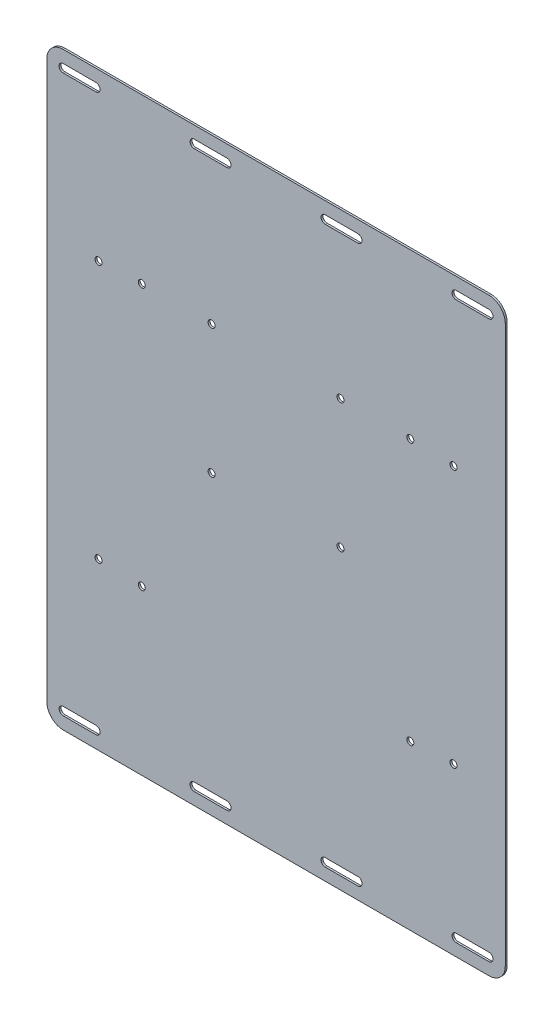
ISO-10303-21;
HEADER;
FILE_DESCRIPTION(('STEP AP214'),'2;1');
FILE_NAME('part.step','',(''),(''),'','','');
FILE_SCHEMA(('AUTOMOTIVE_DESIGN { 1 0 10303 214 1 1 1 1 }'));
ENDSEC;
DATA;
#1=APPLICATION_CONTEXT('core data for automotive mechanical design processes');
#2=APPLICATION_PROTOCOL_DEFINITION('international standard','automotive_design',2000,#1);
#3=PRODUCT_CONTEXT('',#1,'mechanical');
#4=PRODUCT('Part','Part','',(#3));
#5=PRODUCT_RELATED_PRODUCT_CATEGORY('part','',(#4));
#6=PRODUCT_DEFINITION_FORMATION('','',#4);
#7=PRODUCT_DEFINITION_CONTEXT('part definition',#1,'design');
#8=PRODUCT_DEFINITION('design','',#6,#7);
#9=PRODUCT_DEFINITION_SHAPE('','',#8);
#10=(LENGTH_UNIT() NAMED_UNIT(*) SI_UNIT(.MILLI.,.METRE.));
#11=(NAMED_UNIT(*) PLANE_ANGLE_UNIT() SI_UNIT($,.RADIAN.));
#12=(NAMED_UNIT(*) SI_UNIT($,.STERADIAN.) SOLID_ANGLE_UNIT());
#13=UNCERTAINTY_MEASURE_WITH_UNIT(LENGTH_MEASURE(1.E-05),#10,'distance_accuracy_value','');
#14=(GEOMETRIC_REPRESENTATION_CONTEXT(3) GLOBAL_UNCERTAINTY_ASSIGNED_CONTEXT((#13)) GLOBAL_UNIT_ASSIGNED_CONTEXT((#10,
#11,#12)) REPRESENTATION_CONTEXT('',''));
#15=CARTESIAN_POINT('',(0.,0.,0.));
#16=DIRECTION('',(0.,0.,1.));
#17=DIRECTION('',(1.,0.,0.));
#18=AXIS2_PLACEMENT_3D('',#15,#16,#17);
#19=CARTESIAN_POINT('',(-165.100000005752,-215.900000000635,-1.5));
#20=DIRECTION('',(0.,0.,1.));
#21=DIRECTION('',(1.,0.,0.));
#22=AXIS2_PLACEMENT_3D('',#19,#20,#21);
#23=CYLINDRICAL_SURFACE('',#22,12.7);
#24=CARTESIAN_POINT('',(-165.100000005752,-215.900000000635,0.));
#25=DIRECTION('',(0.,0.,1.));
#26=DIRECTION('',(1.,0.,0.));
#27=AXIS2_PLACEMENT_3D('',#24,#25,#26);
#28=CIRCLE('',#27,12.7);
#29=CARTESIAN_POINT('',(-177.800000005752,-215.900000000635,0.));
#30=VERTEX_POINT('',#29);
#31=CARTESIAN_POINT('',(-165.100000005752,-228.600000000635,0.));
#32=VERTEX_POINT('',#31);
#33=EDGE_CURVE('E554',#30,#32,#28,.T.);
#34=ORIENTED_EDGE('',*,*,#33,.F.);
#35=DIRECTION('',(0.,0.,1.));
#36=VECTOR('',#35,1.);
#37=CARTESIAN_POINT('',(-177.800000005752,-215.900000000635,-1.5));
#38=LINE('',#37,#36);
#39=CARTESIAN_POINT('',(-177.800000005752,-215.900000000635,-1.5));
#40=VERTEX_POINT('',#39);
#41=EDGE_CURVE('E11',#40,#30,#38,.T.);
#42=ORIENTED_EDGE('',*,*,#41,.F.);
#43=CARTESIAN_POINT('',(-165.100000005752,-215.900000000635,-1.5));
#44=DIRECTION('',(0.,0.,1.));
#45=DIRECTION('',(1.,0.,0.));
#46=AXIS2_PLACEMENT_3D('',#43,#44,#45);
#47=CIRCLE('',#46,12.7);
#48=CARTESIAN_POINT('',(-165.100000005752,-228.600000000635,-1.5));
#49=VERTEX_POINT('',#48);
#50=EDGE_CURVE('E561',#40,#49,#47,.T.);
#51=ORIENTED_EDGE('',*,*,#50,.T.);
#52=DIRECTION('',(0.,0.,1.));
#53=VECTOR('',#52,1.);
#54=CARTESIAN_POINT('',(-165.100000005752,-228.600000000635,-1.5));
#55=LINE('',#54,#53);
#56=EDGE_CURVE('E42',#49,#32,#55,.T.);
#57=ORIENTED_EDGE('',*,*,#56,.T.);
#58=EDGE_LOOP('',(#34,#42,#51,#57));
#59=FACE_BOUND('',#58,.T.);
#60=ADVANCED_FACE('F39',(#59),#23,.T.);
#61=CARTESIAN_POINT('',(-177.800000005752,-215.900000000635,-1.5));
#62=DIRECTION('',(-1.,0.,0.));
#63=DIRECTION('',(0.,-1.,0.));
#64=AXIS2_PLACEMENT_3D('',#61,#62,#63);
#65=PLANE('',#64);
#66=DIRECTION('',(0.,-1.,0.));
#67=VECTOR('',#66,1.);
#68=CARTESIAN_POINT('',(-177.800000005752,-215.900000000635,0.));
#69=LINE('',#68,#67);
#70=CARTESIAN_POINT('',(-177.800000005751,215.899999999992,0.));
#71=VERTEX_POINT('',#70);
#72=EDGE_CURVE('E565',#71,#30,#69,.T.);
#73=ORIENTED_EDGE('',*,*,#72,.F.);
#74=DIRECTION('',(0.,0.,1.));
#75=VECTOR('',#74,1.);
#76=CARTESIAN_POINT('',(-177.800000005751,215.899999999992,-1.5));
#77=LINE('',#76,#75);
#78=CARTESIAN_POINT('',(-177.800000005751,215.899999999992,-1.5));
#79=VERTEX_POINT('',#78);
#80=EDGE_CURVE('E47',#79,#71,#77,.T.);
#81=ORIENTED_EDGE('',*,*,#80,.F.);
#82=DIRECTION('',(0.,-1.,0.));
#83=VECTOR('',#82,1.);
#84=CARTESIAN_POINT('',(-177.800000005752,-215.900000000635,-1.5));
#85=LINE('',#84,#83);
#86=EDGE_CURVE('E583',#79,#40,#85,.T.);
#87=ORIENTED_EDGE('',*,*,#86,.T.);
#88=ORIENTED_EDGE('',*,*,#41,.T.);
#89=EDGE_LOOP('',(#73,#81,#87,#88));
#90=FACE_BOUND('',#89,.T.);
#91=ADVANCED_FACE('F630',(#90),#65,.T.);
#92=CARTESIAN_POINT('',(-165.100000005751,215.899999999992,-1.5));
#93=DIRECTION('',(0.,0.,1.));
#94=DIRECTION('',(1.,0.,0.));
#95=AXIS2_PLACEMENT_3D('',#92,#93,#94);
#96=CYLINDRICAL_SURFACE('',#95,12.6999999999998);
#97=CARTESIAN_POINT('',(-165.100000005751,215.899999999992,0.));
#98=DIRECTION('',(0.,0.,1.));
#99=DIRECTION('',(1.,0.,0.));
#100=AXIS2_PLACEMENT_3D('',#97,#98,#99);
#101=CIRCLE('',#100,12.6999999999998);
#102=CARTESIAN_POINT('',(-165.100000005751,228.599999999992,0.));
#103=VERTEX_POINT('',#102);
#104=EDGE_CURVE('E603',#103,#71,#101,.T.);
#105=ORIENTED_EDGE('',*,*,#104,.F.);
#106=DIRECTION('',(0.,0.,1.));
#107=VECTOR('',#106,1.);
#108=CARTESIAN_POINT('',(-165.100000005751,228.599999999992,-1.5));
#109=LINE('',#108,#107);
#110=CARTESIAN_POINT('',(-165.100000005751,228.599999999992,-1.5));
#111=VERTEX_POINT('',#110);
#112=EDGE_CURVE('E609',#111,#103,#109,.T.);
#113=ORIENTED_EDGE('',*,*,#112,.F.);
#114=CARTESIAN_POINT('',(-165.100000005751,215.899999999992,-1.5));
#115=DIRECTION('',(0.,0.,1.));
#116=DIRECTION('',(1.,0.,0.));
#117=AXIS2_PLACEMENT_3D('',#114,#115,#116);
#118=CIRCLE('',#117,12.6999999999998);
#119=EDGE_CURVE('E580',#111,#79,#118,.T.);
#120=ORIENTED_EDGE('',*,*,#119,.T.);
#121=ORIENTED_EDGE('',*,*,#80,.T.);
#122=EDGE_LOOP('',(#105,#113,#120,#121));
#123=FACE_BOUND('',#122,.T.);
#124=ADVANCED_FACE('F650',(#123),#96,.T.);
#125=CARTESIAN_POINT('',(165.100000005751,228.599999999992,-1.5));
#126=DIRECTION('',(0.,1.,0.));
#127=DIRECTION('',(0.,0.,1.));
#128=AXIS2_PLACEMENT_3D('',#125,#126,#127);
#129=PLANE('',#128);
#130=DIRECTION('',(-1.,0.,0.));
#131=VECTOR('',#130,1.);
#132=CARTESIAN_POINT('',(165.100000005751,228.599999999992,0.));
#133=LINE('',#132,#131);
#134=CARTESIAN_POINT('',(165.100000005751,228.599999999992,0.));
#135=VERTEX_POINT('',#134);
#136=EDGE_CURVE('E600',#135,#103,#133,.T.);
#137=ORIENTED_EDGE('',*,*,#136,.F.);
#138=DIRECTION('',(0.,0.,1.));
#139=VECTOR('',#138,1.);
#140=CARTESIAN_POINT('',(165.100000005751,228.599999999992,-1.5));
#141=LINE('',#140,#139);
#142=CARTESIAN_POINT('',(165.100000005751,228.599999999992,-1.5));
#143=VERTEX_POINT('',#142);
#144=EDGE_CURVE('E611',#143,#135,#141,.T.);
#145=ORIENTED_EDGE('',*,*,#144,.F.);
#146=DIRECTION('',(-1.,0.,0.));
#147=VECTOR('',#146,1.);
#148=CARTESIAN_POINT('',(165.100000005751,228.599999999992,-1.5));
#149=LINE('',#148,#147);
#150=EDGE_CURVE('E577',#143,#111,#149,.T.);
#151=ORIENTED_EDGE('',*,*,#150,.T.);
#152=ORIENTED_EDGE('',*,*,#112,.T.);
#153=EDGE_LOOP('',(#137,#145,#151,#152));
#154=FACE_BOUND('',#153,.T.);
#155=ADVANCED_FACE('F648',(#154),#129,.T.);
#156=CARTESIAN_POINT('',(165.100000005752,215.899999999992,-1.5));
#157=DIRECTION('',(0.,0.,1.));
#158=DIRECTION('',(1.,0.,0.));
#159=AXIS2_PLACEMENT_3D('',#156,#157,#158);
#160=CYLINDRICAL_SURFACE('',#159,12.6999999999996);
#161=CARTESIAN_POINT('',(165.100000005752,215.899999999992,0.));
#162=DIRECTION('',(0.,0.,1.));
#163=DIRECTION('',(1.,0.,0.));
#164=AXIS2_PLACEMENT_3D('',#161,#162,#163);
#165=CIRCLE('',#164,12.6999999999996);
#166=CARTESIAN_POINT('',(177.800000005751,215.899999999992,0.));
#167=VERTEX_POINT('',#166);
#168=EDGE_CURVE('E597',#167,#135,#165,.T.);
#169=ORIENTED_EDGE('',*,*,#168,.F.);
#170=DIRECTION('',(0.,0.,1.));
#171=VECTOR('',#170,1.);
#172=CARTESIAN_POINT('',(177.800000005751,215.899999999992,-1.5));
#173=LINE('',#172,#171);
#174=CARTESIAN_POINT('',(177.800000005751,215.899999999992,-1.5));
#175=VERTEX_POINT('',#174);
#176=EDGE_CURVE('E613',#175,#167,#173,.T.);
#177=ORIENTED_EDGE('',*,*,#176,.F.);
#178=CARTESIAN_POINT('',(165.100000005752,215.899999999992,-1.5));
#179=DIRECTION('',(0.,0.,1.));
#180=DIRECTION('',(1.,0.,0.));
#181=AXIS2_PLACEMENT_3D('',#178,#179,#180);
#182=CIRCLE('',#181,12.6999999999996);
#183=EDGE_CURVE('E574',#175,#143,#182,.T.);
#184=ORIENTED_EDGE('',*,*,#183,.T.);
#185=ORIENTED_EDGE('',*,*,#144,.T.);
#186=EDGE_LOOP('',(#169,#177,#184,#185));
#187=FACE_BOUND('',#186,.T.);
#188=ADVANCED_FACE('F644',(#187),#160,.T.);
#189=CARTESIAN_POINT('',(177.800000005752,-215.900000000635,-1.5));
#190=DIRECTION('',(1.,0.,0.));
#191=DIRECTION('',(0.,1.,0.));
#192=AXIS2_PLACEMENT_3D('',#189,#190,#191);
#193=PLANE('',#192);
#194=DIRECTION('',(0.,1.,0.));
#195=VECTOR('',#194,1.);
#196=CARTESIAN_POINT('',(177.800000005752,-215.900000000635,0.));
#197=LINE('',#196,#195);
#198=CARTESIAN_POINT('',(177.800000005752,-215.900000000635,0.));
#199=VERTEX_POINT('',#198);
#200=EDGE_CURVE('E594',#199,#167,#197,.T.);
#201=ORIENTED_EDGE('',*,*,#200,.F.);
#202=DIRECTION('',(0.,0.,1.));
#203=VECTOR('',#202,1.);
#204=CARTESIAN_POINT('',(177.800000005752,-215.900000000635,-1.5));
#205=LINE('',#204,#203);
#206=CARTESIAN_POINT('',(177.800000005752,-215.900000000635,-1.5));
#207=VERTEX_POINT('',#206);
#208=EDGE_CURVE('E615',#207,#199,#205,.T.);
#209=ORIENTED_EDGE('',*,*,#208,.F.);
#210=DIRECTION('',(0.,1.,0.));
#211=VECTOR('',#210,1.);
#212=CARTESIAN_POINT('',(177.800000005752,-215.900000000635,-1.5));
#213=LINE('',#212,#211);
#214=EDGE_CURVE('E571',#207,#175,#213,.T.);
#215=ORIENTED_EDGE('',*,*,#214,.T.);
#216=ORIENTED_EDGE('',*,*,#176,.T.);
#217=EDGE_LOOP('',(#201,#209,#215,#216));
#218=FACE_BOUND('',#217,.T.);
#219=ADVANCED_FACE('F642',(#218),#193,.T.);
#220=CARTESIAN_POINT('',(165.100000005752,-215.900000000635,-1.5));
#221=DIRECTION('',(0.,0.,1.));
#222=DIRECTION('',(1.,0.,0.));
#223=AXIS2_PLACEMENT_3D('',#220,#221,#222);
#224=CYLINDRICAL_SURFACE('',#223,12.7);
#225=CARTESIAN_POINT('',(165.100000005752,-215.900000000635,0.));
#226=DIRECTION('',(0.,0.,1.));
#227=DIRECTION('',(1.,0.,0.));
#228=AXIS2_PLACEMENT_3D('',#225,#226,#227);
#229=CIRCLE('',#228,12.7);
#230=CARTESIAN_POINT('',(165.100000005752,-228.600000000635,0.));
#231=VERTEX_POINT('',#230);
#232=EDGE_CURVE('E591',#231,#199,#229,.T.);
#233=ORIENTED_EDGE('',*,*,#232,.F.);
#234=DIRECTION('',(0.,0.,1.));
#235=VECTOR('',#234,1.);
#236=CARTESIAN_POINT('',(165.100000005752,-228.600000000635,-1.5));
#237=LINE('',#236,#235);
#238=CARTESIAN_POINT('',(165.100000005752,-228.600000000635,-1.5));
#239=VERTEX_POINT('',#238);
#240=EDGE_CURVE('E616',#239,#231,#237,.T.);
#241=ORIENTED_EDGE('',*,*,#240,.F.);
#242=CARTESIAN_POINT('',(165.100000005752,-215.900000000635,-1.5));
#243=DIRECTION('',(0.,0.,1.));
#244=DIRECTION('',(1.,0.,0.));
#245=AXIS2_PLACEMENT_3D('',#242,#243,#244);
#246=CIRCLE('',#245,12.7);
#247=EDGE_CURVE('E568',#239,#207,#246,.T.);
#248=ORIENTED_EDGE('',*,*,#247,.T.);
#249=ORIENTED_EDGE('',*,*,#208,.T.);
#250=EDGE_LOOP('',(#233,#241,#248,#249));
#251=FACE_BOUND('',#250,.T.);
#252=ADVANCED_FACE('F638',(#251),#224,.T.);
#253=CARTESIAN_POINT('',(165.100000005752,-228.600000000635,-1.5));
#254=DIRECTION('',(0.,-1.,0.));
#255=DIRECTION('',(0.,0.,-1.));
#256=AXIS2_PLACEMENT_3D('',#253,#254,#255);
#257=PLANE('',#256);
#258=DIRECTION('',(1.,0.,0.));
#259=VECTOR('',#258,1.);
#260=CARTESIAN_POINT('',(165.100000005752,-228.600000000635,0.));
#261=LINE('',#260,#259);
#262=EDGE_CURVE('E588',#32,#231,#261,.T.);
#263=ORIENTED_EDGE('',*,*,#262,.F.);
#264=ORIENTED_EDGE('',*,*,#56,.F.);
#265=DIRECTION('',(1.,0.,0.));
#266=VECTOR('',#265,1.);
#267=CARTESIAN_POINT('',(165.100000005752,-228.600000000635,-1.5));
#268=LINE('',#267,#266);
#269=EDGE_CURVE('E564',#49,#239,#268,.T.);
#270=ORIENTED_EDGE('',*,*,#269,.T.);
#271=ORIENTED_EDGE('',*,*,#240,.T.);
#272=EDGE_LOOP('',(#263,#264,#270,#271));
#273=FACE_BOUND('',#272,.T.);
#274=ADVANCED_FACE('F624',(#273),#257,.T.);
#275=CARTESIAN_POINT('',(-165.100000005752,-215.900000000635,-1.5));
#276=DIRECTION('',(0.,0.,1.));
#277=DIRECTION('',(1.,0.,0.));
#278=AXIS2_PLACEMENT_3D('',#275,#276,#277);
#279=PLANE('',#278);
#280=CARTESIAN_POINT('',(-50.,1.60000000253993,-1.5));
#281=DIRECTION('',(0.,0.,1.));
#282=DIRECTION('',(1.,0.,0.));
#283=AXIS2_PLACEMENT_3D('',#280,#281,#282);
#284=CIRCLE('',#283,2.7178);
#285=CARTESIAN_POINT('',(-47.2822,1.60000000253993,-1.5));
#286=VERTEX_POINT('',#285);
#287=EDGE_CURVE('E1277',#286,#286,#284,.T.);
#288=ORIENTED_EDGE('',*,*,#287,.T.);
#289=EDGE_LOOP('',(#288));
#290=FACE_BOUND('',#289,.T.);
#291=CARTESIAN_POINT('',(50.,1.60000000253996,-1.5));
#292=DIRECTION('',(0.,0.,1.));
#293=DIRECTION('',(1.,0.,0.));
#294=AXIS2_PLACEMENT_3D('',#291,#292,#293);
#295=CIRCLE('',#294,2.7178);
#296=CARTESIAN_POINT('',(52.7178,1.60000000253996,-1.5));
#297=VERTEX_POINT('',#296);
#298=EDGE_CURVE('E1285',#297,#297,#295,.T.);
#299=ORIENTED_EDGE('',*,*,#298,.T.);
#300=EDGE_LOOP('',(#299));
#301=FACE_BOUND('',#300,.T.);
#302=CARTESIAN_POINT('',(50.,101.60000000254,-1.5));
#303=DIRECTION('',(0.,0.,1.));
#304=DIRECTION('',(1.,0.,0.));
#305=AXIS2_PLACEMENT_3D('',#302,#303,#304);
#306=CIRCLE('',#305,2.71780000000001);
#307=CARTESIAN_POINT('',(52.7178,101.60000000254,-1.5));
#308=VERTEX_POINT('',#307);
#309=EDGE_CURVE('E1291',#308,#308,#306,.T.);
#310=ORIENTED_EDGE('',*,*,#309,.T.);
#311=EDGE_LOOP('',(#310));
#312=FACE_BOUND('',#311,.T.);
#313=CARTESIAN_POINT('',(-50.,101.60000000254,-1.5));
#314=DIRECTION('',(0.,0.,1.));
#315=DIRECTION('',(1.,0.,0.));
#316=AXIS2_PLACEMENT_3D('',#313,#314,#315);
#317=CIRCLE('',#316,2.7178);
#318=CARTESIAN_POINT('',(-47.2822,101.60000000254,-1.5));
#319=VERTEX_POINT('',#318);
#320=EDGE_CURVE('E1297',#319,#319,#317,.T.);
#321=ORIENTED_EDGE('',*,*,#320,.T.);
#322=EDGE_LOOP('',(#321));
#323=FACE_BOUND('',#322,.T.);
#324=CARTESIAN_POINT('',(137.66799991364,100.07600000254,-1.5));
#325=DIRECTION('',(0.,0.,1.));
#326=DIRECTION('',(1.,0.,0.));
#327=AXIS2_PLACEMENT_3D('',#324,#325,#326);
#328=CIRCLE('',#327,2.71779999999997);
#329=CARTESIAN_POINT('',(140.38579991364,100.07600000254,-1.5));
#330=VERTEX_POINT('',#329);
#331=EDGE_CURVE('E1303',#330,#330,#328,.T.);
#332=ORIENTED_EDGE('',*,*,#331,.T.);
#333=EDGE_LOOP('',(#332));
#334=FACE_BOUND('',#333,.T.);
#335=CARTESIAN_POINT('',(137.66799991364,-100.07599999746,-1.5));
#336=DIRECTION('',(0.,0.,1.));
#337=DIRECTION('',(1.,0.,0.));
#338=AXIS2_PLACEMENT_3D('',#335,#336,#337);
#339=CIRCLE('',#338,2.71779999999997);
#340=CARTESIAN_POINT('',(140.38579991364,-100.07599999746,-1.5));
#341=VERTEX_POINT('',#340);
#342=EDGE_CURVE('E1309',#341,#341,#339,.T.);
#343=ORIENTED_EDGE('',*,*,#342,.T.);
#344=EDGE_LOOP('',(#343));
#345=FACE_BOUND('',#344,.T.);
#346=CARTESIAN_POINT('',(-137.66800008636,-100.07599999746,-1.5));
#347=DIRECTION('',(0.,0.,1.));
#348=DIRECTION('',(1.,0.,0.));
#349=AXIS2_PLACEMENT_3D('',#346,#347,#348);
#350=CIRCLE('',#349,2.7178);
#351=CARTESIAN_POINT('',(-134.95020008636,-100.07599999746,-1.5));
#352=VERTEX_POINT('',#351);
#353=EDGE_CURVE('E1315',#352,#352,#350,.T.);
#354=ORIENTED_EDGE('',*,*,#353,.T.);
#355=EDGE_LOOP('',(#354));
#356=FACE_BOUND('',#355,.T.);
#357=CARTESIAN_POINT('',(-137.66800008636,100.07600000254,-1.5));
#358=DIRECTION('',(0.,0.,1.));
#359=DIRECTION('',(1.,0.,0.));
#360=AXIS2_PLACEMENT_3D('',#357,#358,#359);
#361=CIRCLE('',#360,2.7178);
#362=CARTESIAN_POINT('',(-134.95020008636,100.07600000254,-1.5));
#363=VERTEX_POINT('',#362);
#364=EDGE_CURVE('E1321',#363,#363,#361,.T.);
#365=ORIENTED_EDGE('',*,*,#364,.T.);
#366=EDGE_LOOP('',(#365));
#367=FACE_BOUND('',#366,.T.);
#368=CARTESIAN_POINT('',(104.13999991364,101.60000000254,-1.5));
#369=DIRECTION('',(0.,0.,1.));
#370=DIRECTION('',(1.,0.,0.));
#371=AXIS2_PLACEMENT_3D('',#368,#369,#370);
#372=CIRCLE('',#371,2.71779999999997);
#373=CARTESIAN_POINT('',(106.85779991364,101.60000000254,-1.5));
#374=VERTEX_POINT('',#373);
#375=EDGE_CURVE('E1327',#374,#374,#372,.T.);
#376=ORIENTED_EDGE('',*,*,#375,.T.);
#377=EDGE_LOOP('',(#376));
#378=FACE_BOUND('',#377,.T.);
#379=CARTESIAN_POINT('',(104.13999991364,-101.59999999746,-1.5));
#380=DIRECTION('',(0.,0.,1.));
#381=DIRECTION('',(1.,0.,0.));
#382=AXIS2_PLACEMENT_3D('',#379,#380,#381);
#383=CIRCLE('',#382,2.71779999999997);
#384=CARTESIAN_POINT('',(106.85779991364,-101.59999999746,-1.5));
#385=VERTEX_POINT('',#384);
#386=EDGE_CURVE('E1333',#385,#385,#383,.T.);
#387=ORIENTED_EDGE('',*,*,#386,.T.);
#388=EDGE_LOOP('',(#387));
#389=FACE_BOUND('',#388,.T.);
#390=CARTESIAN_POINT('',(-104.14000008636,-101.59999999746,-1.5));
#391=DIRECTION('',(0.,0.,1.));
#392=DIRECTION('',(1.,0.,0.));
#393=AXIS2_PLACEMENT_3D('',#390,#391,#392);
#394=CIRCLE('',#393,2.71779999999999);
#395=CARTESIAN_POINT('',(-101.42220008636,-101.59999999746,-1.5));
#396=VERTEX_POINT('',#395);
#397=EDGE_CURVE('E1339',#396,#396,#394,.T.);
#398=ORIENTED_EDGE('',*,*,#397,.T.);
#399=EDGE_LOOP('',(#398));
#400=FACE_BOUND('',#399,.T.);
#401=CARTESIAN_POINT('',(-104.14000008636,101.60000000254,-1.5));
#402=DIRECTION('',(0.,0.,1.));
#403=DIRECTION('',(1.,0.,0.));
#404=AXIS2_PLACEMENT_3D('',#401,#402,#403);
#405=CIRCLE('',#404,2.71779999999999);
#406=CARTESIAN_POINT('',(-101.42220008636,101.60000000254,-1.5));
#407=VERTEX_POINT('',#406);
#408=EDGE_CURVE('E327',#407,#407,#405,.T.);
#409=ORIENTED_EDGE('',*,*,#408,.T.);
#410=EDGE_LOOP('',(#409));
#411=FACE_BOUND('',#410,.T.);
#412=DIRECTION('',(1.,0.,0.));
#413=VECTOR('',#412,1.);
#414=CARTESIAN_POINT('',(165.100000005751,212.724999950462,-1.5));
#415=LINE('',#414,#413);
#416=CARTESIAN_POINT('',(139.700000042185,212.724999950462,-1.5));
#417=VERTEX_POINT('',#416);
#418=CARTESIAN_POINT('',(165.100000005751,212.724999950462,-1.5));
#419=VERTEX_POINT('',#418);
#420=EDGE_CURVE('E304',#417,#419,#415,.T.);
#421=ORIENTED_EDGE('',*,*,#420,.T.);
#422=CARTESIAN_POINT('',(165.100000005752,215.899999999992,-1.5));
#423=DIRECTION('',(0.,0.,1.));
#424=DIRECTION('',(1.,0.,0.));
#425=AXIS2_PLACEMENT_3D('',#422,#423,#424);
#426=CIRCLE('',#425,3.17500004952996);
#427=CARTESIAN_POINT('',(165.100000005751,219.075000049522,-1.5));
#428=VERTEX_POINT('',#427);
#429=EDGE_CURVE('E298',#419,#428,#426,.T.);
#430=ORIENTED_EDGE('',*,*,#429,.T.);
#431=DIRECTION('',(-1.,0.,0.));
#432=VECTOR('',#431,1.);
#433=CARTESIAN_POINT('',(165.100000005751,219.075000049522,-1.5));
#434=LINE('',#433,#432);
#435=CARTESIAN_POINT('',(139.700000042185,219.075000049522,-1.5));
#436=VERTEX_POINT('',#435);
#437=EDGE_CURVE('E307',#428,#436,#434,.T.);
#438=ORIENTED_EDGE('',*,*,#437,.T.);
#439=CARTESIAN_POINT('',(139.700000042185,215.899999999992,-1.5));
#440=DIRECTION('',(0.,0.,1.));
#441=DIRECTION('',(1.,0.,0.));
#442=AXIS2_PLACEMENT_3D('',#439,#440,#441);
#443=CIRCLE('',#442,3.17500004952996);
#444=EDGE_CURVE('E55',#436,#417,#443,.T.);
#445=ORIENTED_EDGE('',*,*,#444,.T.);
#446=EDGE_LOOP('',(#421,#430,#438,#445));
#447=FACE_BOUND('',#446,.T.);
#448=DIRECTION('',(1.,0.,0.));
#449=VECTOR('',#448,1.);
#450=CARTESIAN_POINT('',(63.4999999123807,212.724999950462,-1.5));
#451=LINE('',#450,#449);
#452=CARTESIAN_POINT('',(38.0999999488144,212.724999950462,-1.5));
#453=VERTEX_POINT('',#452);
#454=CARTESIAN_POINT('',(63.4999999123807,212.724999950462,-1.5));
#455=VERTEX_POINT('',#454);
#456=EDGE_CURVE('E347',#453,#455,#451,.T.);
#457=ORIENTED_EDGE('',*,*,#456,.T.);
#458=CARTESIAN_POINT('',(63.4999999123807,215.899999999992,-1.5));
#459=DIRECTION('',(0.,0.,1.));
#460=DIRECTION('',(1.,0.,0.));
#461=AXIS2_PLACEMENT_3D('',#458,#459,#460);
#462=CIRCLE('',#461,3.17500004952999);
#463=CARTESIAN_POINT('',(63.4999999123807,219.075000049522,-1.5));
#464=VERTEX_POINT('',#463);
#465=EDGE_CURVE('E337',#455,#464,#462,.T.);
#466=ORIENTED_EDGE('',*,*,#465,.T.);
#467=DIRECTION('',(-1.,0.,0.));
#468=VECTOR('',#467,1.);
#469=CARTESIAN_POINT('',(63.4999999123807,219.075000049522,-1.5));
#470=LINE('',#469,#468);
#471=CARTESIAN_POINT('',(38.0999999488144,219.075000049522,-1.5));
#472=VERTEX_POINT('',#471);
#473=EDGE_CURVE('E340',#464,#472,#470,.T.);
#474=ORIENTED_EDGE('',*,*,#473,.T.);
#475=CARTESIAN_POINT('',(38.0999999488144,215.899999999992,-1.5));
#476=DIRECTION('',(0.,0.,1.));
#477=DIRECTION('',(1.,0.,0.));
#478=AXIS2_PLACEMENT_3D('',#475,#476,#477);
#479=CIRCLE('',#478,3.17500004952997);
#480=EDGE_CURVE('E344',#472,#453,#479,.T.);
#481=ORIENTED_EDGE('',*,*,#480,.T.);
#482=EDGE_LOOP('',(#457,#466,#474,#481));
#483=FACE_BOUND('',#482,.T.);
#484=DIRECTION('',(1.,0.,0.));
#485=VECTOR('',#484,1.);
#486=CARTESIAN_POINT('',(-38.1000000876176,212.724999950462,-1.5));
#487=LINE('',#486,#485);
#488=CARTESIAN_POINT('',(-63.500000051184,212.724999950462,-1.5));
#489=VERTEX_POINT('',#488);
#490=CARTESIAN_POINT('',(-38.1000000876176,212.724999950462,-1.5));
#491=VERTEX_POINT('',#490);
#492=EDGE_CURVE('E379',#489,#491,#487,.T.);
#493=ORIENTED_EDGE('',*,*,#492,.T.);
#494=CARTESIAN_POINT('',(-38.1000000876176,215.899999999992,-1.5));
#495=DIRECTION('',(0.,0.,1.));
#496=DIRECTION('',(1.,0.,0.));
#497=AXIS2_PLACEMENT_3D('',#494,#495,#496);
#498=CIRCLE('',#497,3.17500004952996);
#499=CARTESIAN_POINT('',(-38.1000000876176,219.075000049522,-1.5));
#500=VERTEX_POINT('',#499);
#501=EDGE_CURVE('E369',#491,#500,#498,.T.);
#502=ORIENTED_EDGE('',*,*,#501,.T.);
#503=DIRECTION('',(-1.,0.,0.));
#504=VECTOR('',#503,1.);
#505=CARTESIAN_POINT('',(-38.1000000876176,219.075000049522,-1.5));
#506=LINE('',#505,#504);
#507=CARTESIAN_POINT('',(-63.500000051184,219.075000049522,-1.5));
#508=VERTEX_POINT('',#507);
#509=EDGE_CURVE('E372',#500,#508,#506,.T.);
#510=ORIENTED_EDGE('',*,*,#509,.T.);
#511=CARTESIAN_POINT('',(-63.500000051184,215.899999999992,-1.5));
#512=DIRECTION('',(0.,0.,1.));
#513=DIRECTION('',(1.,0.,0.));
#514=AXIS2_PLACEMENT_3D('',#511,#512,#513);
#515=CIRCLE('',#514,3.17500004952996);
#516=EDGE_CURVE('E376',#508,#489,#515,.T.);
#517=ORIENTED_EDGE('',*,*,#516,.T.);
#518=EDGE_LOOP('',(#493,#502,#510,#517));
#519=FACE_BOUND('',#518,.T.);
#520=DIRECTION('',(1.,0.,0.));
#521=VECTOR('',#520,1.);
#522=CARTESIAN_POINT('',(-139.700000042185,212.724999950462,-1.5));
#523=LINE('',#522,#521);
#524=CARTESIAN_POINT('',(-165.100000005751,212.724999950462,-1.5));
#525=VERTEX_POINT('',#524);
#526=CARTESIAN_POINT('',(-139.700000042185,212.724999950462,-1.5));
#527=VERTEX_POINT('',#526);
#528=EDGE_CURVE('E411',#525,#527,#523,.T.);
#529=ORIENTED_EDGE('',*,*,#528,.T.);
#530=CARTESIAN_POINT('',(-139.700000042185,215.899999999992,-1.5));
#531=DIRECTION('',(0.,0.,1.));
#532=DIRECTION('',(1.,0.,0.));
#533=AXIS2_PLACEMENT_3D('',#530,#531,#532);
#534=CIRCLE('',#533,3.17500004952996);
#535=CARTESIAN_POINT('',(-139.700000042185,219.075000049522,-1.5));
#536=VERTEX_POINT('',#535);
#537=EDGE_CURVE('E401',#527,#536,#534,.T.);
#538=ORIENTED_EDGE('',*,*,#537,.T.);
#539=DIRECTION('',(-1.,0.,0.));
#540=VECTOR('',#539,1.);
#541=CARTESIAN_POINT('',(-139.700000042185,219.075000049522,-1.5));
#542=LINE('',#541,#540);
#543=CARTESIAN_POINT('',(-165.100000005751,219.075000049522,-1.5));
#544=VERTEX_POINT('',#543);
#545=EDGE_CURVE('E404',#536,#544,#542,.T.);
#546=ORIENTED_EDGE('',*,*,#545,.T.);
#547=CARTESIAN_POINT('',(-165.100000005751,215.899999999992,-1.5));
#548=DIRECTION('',(0.,0.,1.));
#549=DIRECTION('',(1.,0.,0.));
#550=AXIS2_PLACEMENT_3D('',#547,#548,#549);
#551=CIRCLE('',#550,3.17500004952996);
#552=EDGE_CURVE('E408',#544,#525,#551,.T.);
#553=ORIENTED_EDGE('',*,*,#552,.T.);
#554=EDGE_LOOP('',(#529,#538,#546,#553));
#555=FACE_BOUND('',#554,.T.);
#556=DIRECTION('',(1.,0.,0.));
#557=VECTOR('',#556,1.);
#558=CARTESIAN_POINT('',(165.100000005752,-219.075000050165,-1.5));
#559=LINE('',#558,#557);
#560=CARTESIAN_POINT('',(139.700000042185,-219.075000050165,-1.5));
#561=VERTEX_POINT('',#560);
#562=CARTESIAN_POINT('',(165.100000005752,-219.075000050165,-1.5));
#563=VERTEX_POINT('',#562);
#564=EDGE_CURVE('E443',#561,#563,#559,.T.);
#565=ORIENTED_EDGE('',*,*,#564,.T.);
#566=CARTESIAN_POINT('',(165.100000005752,-215.900000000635,-1.5));
#567=DIRECTION('',(0.,0.,1.));
#568=DIRECTION('',(1.,0.,0.));
#569=AXIS2_PLACEMENT_3D('',#566,#567,#568);
#570=CIRCLE('',#569,3.17500004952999);
#571=CARTESIAN_POINT('',(165.100000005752,-212.724999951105,-1.5));
#572=VERTEX_POINT('',#571);
#573=EDGE_CURVE('E433',#563,#572,#570,.T.);
#574=ORIENTED_EDGE('',*,*,#573,.T.);
#575=DIRECTION('',(-1.,0.,0.));
#576=VECTOR('',#575,1.);
#577=CARTESIAN_POINT('',(165.100000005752,-212.724999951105,-1.5));
#578=LINE('',#577,#576);
#579=CARTESIAN_POINT('',(139.700000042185,-212.724999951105,-1.5));
#580=VERTEX_POINT('',#579);
#581=EDGE_CURVE('E436',#572,#580,#578,.T.);
#582=ORIENTED_EDGE('',*,*,#581,.T.);
#583=CARTESIAN_POINT('',(139.700000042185,-215.900000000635,-1.5));
#584=DIRECTION('',(0.,0.,1.));
#585=DIRECTION('',(1.,0.,0.));
#586=AXIS2_PLACEMENT_3D('',#583,#584,#585);
#587=CIRCLE('',#586,3.17500004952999);
#588=EDGE_CURVE('E440',#580,#561,#587,.T.);
#589=ORIENTED_EDGE('',*,*,#588,.T.);
#590=EDGE_LOOP('',(#565,#574,#582,#589));
#591=FACE_BOUND('',#590,.T.);
#592=DIRECTION('',(1.,0.,0.));
#593=VECTOR('',#592,1.);
#594=CARTESIAN_POINT('',(63.4999999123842,-219.075000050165,-1.5));
#595=LINE('',#594,#593);
#596=CARTESIAN_POINT('',(38.0999999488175,-219.075000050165,-1.5));
#597=VERTEX_POINT('',#596);
#598=CARTESIAN_POINT('',(63.4999999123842,-219.075000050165,-1.5));
#599=VERTEX_POINT('',#598);
#600=EDGE_CURVE('E475',#597,#599,#595,.T.);
#601=ORIENTED_EDGE('',*,*,#600,.T.);
#602=CARTESIAN_POINT('',(63.4999999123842,-215.900000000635,-1.5));
#603=DIRECTION('',(0.,0.,1.));
#604=DIRECTION('',(1.,0.,0.));
#605=AXIS2_PLACEMENT_3D('',#602,#603,#604);
#606=CIRCLE('',#605,3.17500004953);
#607=CARTESIAN_POINT('',(63.4999999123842,-212.724999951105,-1.5));
#608=VERTEX_POINT('',#607);
#609=EDGE_CURVE('E465',#599,#608,#606,.T.);
#610=ORIENTED_EDGE('',*,*,#609,.T.);
#611=DIRECTION('',(-1.,0.,0.));
#612=VECTOR('',#611,1.);
#613=CARTESIAN_POINT('',(63.4999999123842,-212.724999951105,-1.5));
#614=LINE('',#613,#612);
#615=CARTESIAN_POINT('',(38.0999999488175,-212.724999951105,-1.5));
#616=VERTEX_POINT('',#615);
#617=EDGE_CURVE('E468',#608,#616,#614,.T.);
#618=ORIENTED_EDGE('',*,*,#617,.T.);
#619=CARTESIAN_POINT('',(38.0999999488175,-215.900000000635,-1.5));
#620=DIRECTION('',(0.,0.,1.));
#621=DIRECTION('',(1.,0.,0.));
#622=AXIS2_PLACEMENT_3D('',#619,#620,#621);
#623=CIRCLE('',#622,3.17500004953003);
#624=EDGE_CURVE('E472',#616,#597,#623,.T.);
#625=ORIENTED_EDGE('',*,*,#624,.T.);
#626=EDGE_LOOP('',(#601,#610,#618,#625));
#627=FACE_BOUND('',#626,.T.);
#628=DIRECTION('',(1.,0.,0.));
#629=VECTOR('',#628,1.);
#630=CARTESIAN_POINT('',(-38.1000000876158,-219.075000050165,-1.5));
#631=LINE('',#630,#629);
#632=CARTESIAN_POINT('',(-63.5000000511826,-219.075000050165,-1.5));
#633=VERTEX_POINT('',#632);
#634=CARTESIAN_POINT('',(-38.1000000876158,-219.075000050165,-1.5));
#635=VERTEX_POINT('',#634);
#636=EDGE_CURVE('E507',#633,#635,#631,.T.);
#637=ORIENTED_EDGE('',*,*,#636,.T.);
#638=CARTESIAN_POINT('',(-38.1000000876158,-215.900000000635,-1.5));
#639=DIRECTION('',(0.,0.,1.));
#640=DIRECTION('',(1.,0.,0.));
#641=AXIS2_PLACEMENT_3D('',#638,#639,#640);
#642=CIRCLE('',#641,3.17500004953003);
#643=CARTESIAN_POINT('',(-38.1000000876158,-212.724999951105,-1.5));
#644=VERTEX_POINT('',#643);
#645=EDGE_CURVE('E497',#635,#644,#642,.T.);
#646=ORIENTED_EDGE('',*,*,#645,.T.);
#647=DIRECTION('',(-1.,0.,0.));
#648=VECTOR('',#647,1.);
#649=CARTESIAN_POINT('',(-38.1000000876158,-212.724999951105,-1.5));
#650=LINE('',#649,#648);
#651=CARTESIAN_POINT('',(-63.5000000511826,-212.724999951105,-1.5));
#652=VERTEX_POINT('',#651);
#653=EDGE_CURVE('E500',#644,#652,#650,.T.);
#654=ORIENTED_EDGE('',*,*,#653,.T.);
#655=CARTESIAN_POINT('',(-63.5000000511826,-215.900000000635,-1.5));
#656=DIRECTION('',(0.,0.,1.));
#657=DIRECTION('',(1.,0.,0.));
#658=AXIS2_PLACEMENT_3D('',#655,#656,#657);
#659=CIRCLE('',#658,3.17500004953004);
#660=EDGE_CURVE('E504',#652,#633,#659,.T.);
#661=ORIENTED_EDGE('',*,*,#660,.T.);
#662=EDGE_LOOP('',(#637,#646,#654,#661));
#663=FACE_BOUND('',#662,.T.);
#664=DIRECTION('',(1.,0.,0.));
#665=VECTOR('',#664,1.);
#666=CARTESIAN_POINT('',(-139.700000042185,-219.075000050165,-1.5));
#667=LINE('',#666,#665);
#668=CARTESIAN_POINT('',(-165.100000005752,-219.075000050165,-1.5));
#669=VERTEX_POINT('',#668);
#670=CARTESIAN_POINT('',(-139.700000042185,-219.075000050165,-1.5));
#671=VERTEX_POINT('',#670);
#672=EDGE_CURVE('E539',#669,#671,#667,.T.);
#673=ORIENTED_EDGE('',*,*,#672,.T.);
#674=CARTESIAN_POINT('',(-139.700000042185,-215.900000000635,-1.5));
#675=DIRECTION('',(0.,0.,1.));
#676=DIRECTION('',(1.,0.,0.));
#677=AXIS2_PLACEMENT_3D('',#674,#675,#676);
#678=CIRCLE('',#677,3.17500004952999);
#679=CARTESIAN_POINT('',(-139.700000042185,-212.724999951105,-1.5));
#680=VERTEX_POINT('',#679);
#681=EDGE_CURVE('E529',#671,#680,#678,.T.);
#682=ORIENTED_EDGE('',*,*,#681,.T.);
#683=DIRECTION('',(-1.,0.,0.));
#684=VECTOR('',#683,1.);
#685=CARTESIAN_POINT('',(-139.700000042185,-212.724999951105,-1.5));
#686=LINE('',#685,#684);
#687=CARTESIAN_POINT('',(-165.100000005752,-212.724999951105,-1.5));
#688=VERTEX_POINT('',#687);
#689=EDGE_CURVE('E532',#680,#688,#686,.T.);
#690=ORIENTED_EDGE('',*,*,#689,.T.);
#691=CARTESIAN_POINT('',(-165.100000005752,-215.900000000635,-1.5));
#692=DIRECTION('',(0.,0.,1.));
#693=DIRECTION('',(1.,0.,0.));
#694=AXIS2_PLACEMENT_3D('',#691,#692,#693);
#695=CIRCLE('',#694,3.17500004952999);
#696=EDGE_CURVE('E536',#688,#669,#695,.T.);
#697=ORIENTED_EDGE('',*,*,#696,.T.);
#698=EDGE_LOOP('',(#673,#682,#690,#697));
#699=FACE_BOUND('',#698,.T.);
#700=ORIENTED_EDGE('',*,*,#50,.F.);
#701=ORIENTED_EDGE('',*,*,#86,.F.);
#702=ORIENTED_EDGE('',*,*,#119,.F.);
#703=ORIENTED_EDGE('',*,*,#150,.F.);
#704=ORIENTED_EDGE('',*,*,#183,.F.);
#705=ORIENTED_EDGE('',*,*,#214,.F.);
#706=ORIENTED_EDGE('',*,*,#247,.F.);
#707=ORIENTED_EDGE('',*,*,#269,.F.);
#708=EDGE_LOOP('',(#700,#701,#702,#703,#704,#705,#706,#707));
#709=FACE_BOUND('',#708,.T.);
#710=ADVANCED_FACE('F311',(#290,#301,#312,#323,#334,#345,#356,#367,#378,#389,#400,#411,#447,
#483,#519,#555,#591,#627,#663,#699,#709),#279,.F.);
#711=CARTESIAN_POINT('',(-165.100000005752,-215.900000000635,0.));
#712=DIRECTION('',(0.,0.,1.));
#713=DIRECTION('',(1.,0.,0.));
#714=AXIS2_PLACEMENT_3D('',#711,#712,#713);
#715=PLANE('',#714);
#716=CARTESIAN_POINT('',(-50.,1.60000000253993,0.));
#717=DIRECTION('',(0.,0.,1.));
#718=DIRECTION('',(1.,0.,0.));
#719=AXIS2_PLACEMENT_3D('',#716,#717,#718);
#720=CIRCLE('',#719,2.7178);
#721=CARTESIAN_POINT('',(-47.2822,1.60000000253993,0.));
#722=VERTEX_POINT('',#721);
#723=EDGE_CURVE('E1280',#722,#722,#720,.T.);
#724=ORIENTED_EDGE('',*,*,#723,.F.);
#725=EDGE_LOOP('',(#724));
#726=FACE_BOUND('',#725,.T.);
#727=CARTESIAN_POINT('',(50.,1.60000000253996,0.));
#728=DIRECTION('',(0.,0.,1.));
#729=DIRECTION('',(1.,0.,0.));
#730=AXIS2_PLACEMENT_3D('',#727,#728,#729);
#731=CIRCLE('',#730,2.7178);
#732=CARTESIAN_POINT('',(52.7178,1.60000000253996,0.));
#733=VERTEX_POINT('',#732);
#734=EDGE_CURVE('E1282',#733,#733,#731,.T.);
#735=ORIENTED_EDGE('',*,*,#734,.F.);
#736=EDGE_LOOP('',(#735));
#737=FACE_BOUND('',#736,.T.);
#738=CARTESIAN_POINT('',(50.,101.60000000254,0.));
#739=DIRECTION('',(0.,0.,1.));
#740=DIRECTION('',(1.,0.,0.));
#741=AXIS2_PLACEMENT_3D('',#738,#739,#740);
#742=CIRCLE('',#741,2.71780000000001);
#743=CARTESIAN_POINT('',(52.7178,101.60000000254,0.));
#744=VERTEX_POINT('',#743);
#745=EDGE_CURVE('E1288',#744,#744,#742,.T.);
#746=ORIENTED_EDGE('',*,*,#745,.F.);
#747=EDGE_LOOP('',(#746));
#748=FACE_BOUND('',#747,.T.);
#749=CARTESIAN_POINT('',(-50.,101.60000000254,0.));
#750=DIRECTION('',(0.,0.,1.));
#751=DIRECTION('',(1.,0.,0.));
#752=AXIS2_PLACEMENT_3D('',#749,#750,#751);
#753=CIRCLE('',#752,2.7178);
#754=CARTESIAN_POINT('',(-47.2822,101.60000000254,0.));
#755=VERTEX_POINT('',#754);
#756=EDGE_CURVE('E1294',#755,#755,#753,.T.);
#757=ORIENTED_EDGE('',*,*,#756,.F.);
#758=EDGE_LOOP('',(#757));
#759=FACE_BOUND('',#758,.T.);
#760=CARTESIAN_POINT('',(137.66799991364,100.07600000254,0.));
#761=DIRECTION('',(0.,0.,1.));
#762=DIRECTION('',(1.,0.,0.));
#763=AXIS2_PLACEMENT_3D('',#760,#761,#762);
#764=CIRCLE('',#763,2.71779999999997);
#765=CARTESIAN_POINT('',(140.38579991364,100.07600000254,0.));
#766=VERTEX_POINT('',#765);
#767=EDGE_CURVE('E1300',#766,#766,#764,.T.);
#768=ORIENTED_EDGE('',*,*,#767,.F.);
#769=EDGE_LOOP('',(#768));
#770=FACE_BOUND('',#769,.T.);
#771=CARTESIAN_POINT('',(137.66799991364,-100.07599999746,0.));
#772=DIRECTION('',(0.,0.,1.));
#773=DIRECTION('',(1.,0.,0.));
#774=AXIS2_PLACEMENT_3D('',#771,#772,#773);
#775=CIRCLE('',#774,2.71779999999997);
#776=CARTESIAN_POINT('',(140.38579991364,-100.07599999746,0.));
#777=VERTEX_POINT('',#776);
#778=EDGE_CURVE('E1306',#777,#777,#775,.T.);
#779=ORIENTED_EDGE('',*,*,#778,.F.);
#780=EDGE_LOOP('',(#779));
#781=FACE_BOUND('',#780,.T.);
#782=CARTESIAN_POINT('',(-137.66800008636,-100.07599999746,0.));
#783=DIRECTION('',(0.,0.,1.));
#784=DIRECTION('',(1.,0.,0.));
#785=AXIS2_PLACEMENT_3D('',#782,#783,#784);
#786=CIRCLE('',#785,2.7178);
#787=CARTESIAN_POINT('',(-134.95020008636,-100.07599999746,0.));
#788=VERTEX_POINT('',#787);
#789=EDGE_CURVE('E1312',#788,#788,#786,.T.);
#790=ORIENTED_EDGE('',*,*,#789,.F.);
#791=EDGE_LOOP('',(#790));
#792=FACE_BOUND('',#791,.T.);
#793=CARTESIAN_POINT('',(-137.66800008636,100.07600000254,0.));
#794=DIRECTION('',(0.,0.,1.));
#795=DIRECTION('',(1.,0.,0.));
#796=AXIS2_PLACEMENT_3D('',#793,#794,#795);
#797=CIRCLE('',#796,2.7178);
#798=CARTESIAN_POINT('',(-134.95020008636,100.07600000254,0.));
#799=VERTEX_POINT('',#798);
#800=EDGE_CURVE('E1318',#799,#799,#797,.T.);
#801=ORIENTED_EDGE('',*,*,#800,.F.);
#802=EDGE_LOOP('',(#801));
#803=FACE_BOUND('',#802,.T.);
#804=CARTESIAN_POINT('',(104.13999991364,101.60000000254,0.));
#805=DIRECTION('',(0.,0.,1.));
#806=DIRECTION('',(1.,0.,0.));
#807=AXIS2_PLACEMENT_3D('',#804,#805,#806);
#808=CIRCLE('',#807,2.71779999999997);
#809=CARTESIAN_POINT('',(106.85779991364,101.60000000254,0.));
#810=VERTEX_POINT('',#809);
#811=EDGE_CURVE('E1324',#810,#810,#808,.T.);
#812=ORIENTED_EDGE('',*,*,#811,.F.);
#813=EDGE_LOOP('',(#812));
#814=FACE_BOUND('',#813,.T.);
#815=CARTESIAN_POINT('',(104.13999991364,-101.59999999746,0.));
#816=DIRECTION('',(0.,0.,1.));
#817=DIRECTION('',(1.,0.,0.));
#818=AXIS2_PLACEMENT_3D('',#815,#816,#817);
#819=CIRCLE('',#818,2.71779999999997);
#820=CARTESIAN_POINT('',(106.85779991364,-101.59999999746,0.));
#821=VERTEX_POINT('',#820);
#822=EDGE_CURVE('E1330',#821,#821,#819,.T.);
#823=ORIENTED_EDGE('',*,*,#822,.F.);
#824=EDGE_LOOP('',(#823));
#825=FACE_BOUND('',#824,.T.);
#826=CARTESIAN_POINT('',(-104.14000008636,-101.59999999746,0.));
#827=DIRECTION('',(0.,0.,1.));
#828=DIRECTION('',(1.,0.,0.));
#829=AXIS2_PLACEMENT_3D('',#826,#827,#828);
#830=CIRCLE('',#829,2.71779999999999);
#831=CARTESIAN_POINT('',(-101.42220008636,-101.59999999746,0.));
#832=VERTEX_POINT('',#831);
#833=EDGE_CURVE('E1336',#832,#832,#830,.T.);
#834=ORIENTED_EDGE('',*,*,#833,.F.);
#835=EDGE_LOOP('',(#834));
#836=FACE_BOUND('',#835,.T.);
#837=CARTESIAN_POINT('',(-104.14000008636,101.60000000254,0.));
#838=DIRECTION('',(0.,0.,1.));
#839=DIRECTION('',(1.,0.,0.));
#840=AXIS2_PLACEMENT_3D('',#837,#838,#839);
#841=CIRCLE('',#840,2.71779999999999);
#842=CARTESIAN_POINT('',(-101.42220008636,101.60000000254,0.));
#843=VERTEX_POINT('',#842);
#844=EDGE_CURVE('E320',#843,#843,#841,.T.);
#845=ORIENTED_EDGE('',*,*,#844,.F.);
#846=EDGE_LOOP('',(#845));
#847=FACE_BOUND('',#846,.T.);
#848=CARTESIAN_POINT('',(165.100000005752,215.899999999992,0.));
#849=DIRECTION('',(0.,0.,1.));
#850=DIRECTION('',(1.,0.,0.));
#851=AXIS2_PLACEMENT_3D('',#848,#849,#850);
#852=CIRCLE('',#851,3.17500004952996);
#853=CARTESIAN_POINT('',(165.100000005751,212.724999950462,0.));
#854=VERTEX_POINT('',#853);
#855=CARTESIAN_POINT('',(165.100000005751,219.075000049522,0.));
#856=VERTEX_POINT('',#855);
#857=EDGE_CURVE('E63',#854,#856,#852,.T.);
#858=ORIENTED_EDGE('',*,*,#857,.F.);
#859=DIRECTION('',(1.,0.,0.));
#860=VECTOR('',#859,1.);
#861=CARTESIAN_POINT('',(165.100000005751,212.724999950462,0.));
#862=LINE('',#861,#860);
#863=CARTESIAN_POINT('',(139.700000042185,212.724999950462,0.));
#864=VERTEX_POINT('',#863);
#865=EDGE_CURVE('E314',#864,#854,#862,.T.);
#866=ORIENTED_EDGE('',*,*,#865,.F.);
#867=CARTESIAN_POINT('',(139.700000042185,215.899999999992,0.));
#868=DIRECTION('',(0.,0.,1.));
#869=DIRECTION('',(1.,0.,0.));
#870=AXIS2_PLACEMENT_3D('',#867,#868,#869);
#871=CIRCLE('',#870,3.17500004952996);
#872=CARTESIAN_POINT('',(139.700000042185,219.075000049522,0.));
#873=VERTEX_POINT('',#872);
#874=EDGE_CURVE('E317',#873,#864,#871,.T.);
#875=ORIENTED_EDGE('',*,*,#874,.F.);
#876=DIRECTION('',(-1.,0.,0.));
#877=VECTOR('',#876,1.);
#878=CARTESIAN_POINT('',(165.100000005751,219.075000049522,0.));
#879=LINE('',#878,#877);
#880=EDGE_CURVE('E326',#856,#873,#879,.T.);
#881=ORIENTED_EDGE('',*,*,#880,.F.);
#882=EDGE_LOOP('',(#858,#866,#875,#881));
#883=FACE_BOUND('',#882,.T.);
#884=CARTESIAN_POINT('',(63.4999999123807,215.899999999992,0.));
#885=DIRECTION('',(0.,0.,1.));
#886=DIRECTION('',(1.,0.,0.));
#887=AXIS2_PLACEMENT_3D('',#884,#885,#886);
#888=CIRCLE('',#887,3.17500004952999);
#889=CARTESIAN_POINT('',(63.4999999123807,212.724999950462,0.));
#890=VERTEX_POINT('',#889);
#891=CARTESIAN_POINT('',(63.4999999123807,219.075000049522,0.));
#892=VERTEX_POINT('',#891);
#893=EDGE_CURVE('E333',#890,#892,#888,.T.);
#894=ORIENTED_EDGE('',*,*,#893,.F.);
#895=DIRECTION('',(1.,0.,0.));
#896=VECTOR('',#895,1.);
#897=CARTESIAN_POINT('',(63.4999999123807,212.724999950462,0.));
#898=LINE('',#897,#896);
#899=CARTESIAN_POINT('',(38.0999999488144,212.724999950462,0.));
#900=VERTEX_POINT('',#899);
#901=EDGE_CURVE('E341',#900,#890,#898,.T.);
#902=ORIENTED_EDGE('',*,*,#901,.F.);
#903=CARTESIAN_POINT('',(38.0999999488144,215.899999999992,0.));
#904=DIRECTION('',(0.,0.,1.));
#905=DIRECTION('',(1.,0.,0.));
#906=AXIS2_PLACEMENT_3D('',#903,#904,#905);
#907=CIRCLE('',#906,3.17500004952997);
#908=CARTESIAN_POINT('',(38.0999999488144,219.075000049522,0.));
#909=VERTEX_POINT('',#908);
#910=EDGE_CURVE('E355',#909,#900,#907,.T.);
#911=ORIENTED_EDGE('',*,*,#910,.F.);
#912=DIRECTION('',(-1.,0.,0.));
#913=VECTOR('',#912,1.);
#914=CARTESIAN_POINT('',(63.4999999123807,219.075000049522,0.));
#915=LINE('',#914,#913);
#916=EDGE_CURVE('E352',#892,#909,#915,.T.);
#917=ORIENTED_EDGE('',*,*,#916,.F.);
#918=EDGE_LOOP('',(#894,#902,#911,#917));
#919=FACE_BOUND('',#918,.T.);
#920=CARTESIAN_POINT('',(-38.1000000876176,215.899999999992,0.));
#921=DIRECTION('',(0.,0.,1.));
#922=DIRECTION('',(1.,0.,0.));
#923=AXIS2_PLACEMENT_3D('',#920,#921,#922);
#924=CIRCLE('',#923,3.17500004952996);
#925=CARTESIAN_POINT('',(-38.1000000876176,212.724999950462,0.));
#926=VERTEX_POINT('',#925);
#927=CARTESIAN_POINT('',(-38.1000000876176,219.075000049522,0.));
#928=VERTEX_POINT('',#927);
#929=EDGE_CURVE('E362',#926,#928,#924,.T.);
#930=ORIENTED_EDGE('',*,*,#929,.F.);
#931=DIRECTION('',(1.,0.,0.));
#932=VECTOR('',#931,1.);
#933=CARTESIAN_POINT('',(-38.1000000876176,212.724999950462,0.));
#934=LINE('',#933,#932);
#935=CARTESIAN_POINT('',(-63.500000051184,212.724999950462,0.));
#936=VERTEX_POINT('',#935);
#937=EDGE_CURVE('E373',#936,#926,#934,.T.);
#938=ORIENTED_EDGE('',*,*,#937,.F.);
#939=CARTESIAN_POINT('',(-63.500000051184,215.899999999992,0.));
#940=DIRECTION('',(0.,0.,1.));
#941=DIRECTION('',(1.,0.,0.));
#942=AXIS2_PLACEMENT_3D('',#939,#940,#941);
#943=CIRCLE('',#942,3.17500004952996);
#944=CARTESIAN_POINT('',(-63.500000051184,219.075000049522,0.));
#945=VERTEX_POINT('',#944);
#946=EDGE_CURVE('E387',#945,#936,#943,.T.);
#947=ORIENTED_EDGE('',*,*,#946,.F.);
#948=DIRECTION('',(-1.,0.,0.));
#949=VECTOR('',#948,1.);
#950=CARTESIAN_POINT('',(-38.1000000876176,219.075000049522,0.));
#951=LINE('',#950,#949);
#952=EDGE_CURVE('E384',#928,#945,#951,.T.);
#953=ORIENTED_EDGE('',*,*,#952,.F.);
#954=EDGE_LOOP('',(#930,#938,#947,#953));
#955=FACE_BOUND('',#954,.T.);
#956=CARTESIAN_POINT('',(-139.700000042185,215.899999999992,0.));
#957=DIRECTION('',(0.,0.,1.));
#958=DIRECTION('',(1.,0.,0.));
#959=AXIS2_PLACEMENT_3D('',#956,#957,#958);
#960=CIRCLE('',#959,3.17500004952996);
#961=CARTESIAN_POINT('',(-139.700000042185,212.724999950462,0.));
#962=VERTEX_POINT('',#961);
#963=CARTESIAN_POINT('',(-139.700000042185,219.075000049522,0.));
#964=VERTEX_POINT('',#963);
#965=EDGE_CURVE('E394',#962,#964,#960,.T.);
#966=ORIENTED_EDGE('',*,*,#965,.F.);
#967=DIRECTION('',(1.,0.,0.));
#968=VECTOR('',#967,1.);
#969=CARTESIAN_POINT('',(-139.700000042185,212.724999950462,0.));
#970=LINE('',#969,#968);
#971=CARTESIAN_POINT('',(-165.100000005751,212.724999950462,0.));
#972=VERTEX_POINT('',#971);
#973=EDGE_CURVE('E405',#972,#962,#970,.T.);
#974=ORIENTED_EDGE('',*,*,#973,.F.);
#975=CARTESIAN_POINT('',(-165.100000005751,215.899999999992,0.));
#976=DIRECTION('',(0.,0.,1.));
#977=DIRECTION('',(1.,0.,0.));
#978=AXIS2_PLACEMENT_3D('',#975,#976,#977);
#979=CIRCLE('',#978,3.17500004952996);
#980=CARTESIAN_POINT('',(-165.100000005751,219.075000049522,0.));
#981=VERTEX_POINT('',#980);
#982=EDGE_CURVE('E419',#981,#972,#979,.T.);
#983=ORIENTED_EDGE('',*,*,#982,.F.);
#984=DIRECTION('',(-1.,0.,0.));
#985=VECTOR('',#984,1.);
#986=CARTESIAN_POINT('',(-139.700000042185,219.075000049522,0.));
#987=LINE('',#986,#985);
#988=EDGE_CURVE('E416',#964,#981,#987,.T.);
#989=ORIENTED_EDGE('',*,*,#988,.F.);
#990=EDGE_LOOP('',(#966,#974,#983,#989));
#991=FACE_BOUND('',#990,.T.);
#992=CARTESIAN_POINT('',(165.100000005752,-215.900000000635,0.));
#993=DIRECTION('',(0.,0.,1.));
#994=DIRECTION('',(1.,0.,0.));
#995=AXIS2_PLACEMENT_3D('',#992,#993,#994);
#996=CIRCLE('',#995,3.17500004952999);
#997=CARTESIAN_POINT('',(165.100000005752,-219.075000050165,0.));
#998=VERTEX_POINT('',#997);
#999=CARTESIAN_POINT('',(165.100000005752,-212.724999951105,0.));
#1000=VERTEX_POINT('',#999);
#1001=EDGE_CURVE('E426',#998,#1000,#996,.T.);
#1002=ORIENTED_EDGE('',*,*,#1001,.F.);
#1003=DIRECTION('',(1.,0.,0.));
#1004=VECTOR('',#1003,1.);
#1005=CARTESIAN_POINT('',(165.100000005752,-219.075000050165,0.));
#1006=LINE('',#1005,#1004);
#1007=CARTESIAN_POINT('',(139.700000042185,-219.075000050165,0.));
#1008=VERTEX_POINT('',#1007);
#1009=EDGE_CURVE('E437',#1008,#998,#1006,.T.);
#1010=ORIENTED_EDGE('',*,*,#1009,.F.);
#1011=CARTESIAN_POINT('',(139.700000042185,-215.900000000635,0.));
#1012=DIRECTION('',(0.,0.,1.));
#1013=DIRECTION('',(1.,0.,0.));
#1014=AXIS2_PLACEMENT_3D('',#1011,#1012,#1013);
#1015=CIRCLE('',#1014,3.17500004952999);
#1016=CARTESIAN_POINT('',(139.700000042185,-212.724999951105,0.));
#1017=VERTEX_POINT('',#1016);
#1018=EDGE_CURVE('E451',#1017,#1008,#1015,.T.);
#1019=ORIENTED_EDGE('',*,*,#1018,.F.);
#1020=DIRECTION('',(-1.,0.,0.));
#1021=VECTOR('',#1020,1.);
#1022=CARTESIAN_POINT('',(165.100000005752,-212.724999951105,0.));
#1023=LINE('',#1022,#1021);
#1024=EDGE_CURVE('E448',#1000,#1017,#1023,.T.);
#1025=ORIENTED_EDGE('',*,*,#1024,.F.);
#1026=EDGE_LOOP('',(#1002,#1010,#1019,#1025));
#1027=FACE_BOUND('',#1026,.T.);
#1028=CARTESIAN_POINT('',(63.4999999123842,-215.900000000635,0.));
#1029=DIRECTION('',(0.,0.,1.));
#1030=DIRECTION('',(1.,0.,0.));
#1031=AXIS2_PLACEMENT_3D('',#1028,#1029,#1030);
#1032=CIRCLE('',#1031,3.17500004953);
#1033=CARTESIAN_POINT('',(63.4999999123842,-219.075000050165,0.));
#1034=VERTEX_POINT('',#1033);
#1035=CARTESIAN_POINT('',(63.4999999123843,-212.724999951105,0.));
#1036=VERTEX_POINT('',#1035);
#1037=EDGE_CURVE('E458',#1034,#1036,#1032,.T.);
#1038=ORIENTED_EDGE('',*,*,#1037,.F.);
#1039=DIRECTION('',(1.,0.,0.));
#1040=VECTOR('',#1039,1.);
#1041=CARTESIAN_POINT('',(63.4999999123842,-219.075000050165,0.));
#1042=LINE('',#1041,#1040);
#1043=CARTESIAN_POINT('',(38.0999999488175,-219.075000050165,0.));
#1044=VERTEX_POINT('',#1043);
#1045=EDGE_CURVE('E469',#1044,#1034,#1042,.T.);
#1046=ORIENTED_EDGE('',*,*,#1045,.F.);
#1047=CARTESIAN_POINT('',(38.0999999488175,-215.900000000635,0.));
#1048=DIRECTION('',(0.,0.,1.));
#1049=DIRECTION('',(1.,0.,0.));
#1050=AXIS2_PLACEMENT_3D('',#1047,#1048,#1049);
#1051=CIRCLE('',#1050,3.17500004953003);
#1052=CARTESIAN_POINT('',(38.0999999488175,-212.724999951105,0.));
#1053=VERTEX_POINT('',#1052);
#1054=EDGE_CURVE('E483',#1053,#1044,#1051,.T.);
#1055=ORIENTED_EDGE('',*,*,#1054,.F.);
#1056=DIRECTION('',(-1.,0.,0.));
#1057=VECTOR('',#1056,1.);
#1058=CARTESIAN_POINT('',(63.4999999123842,-212.724999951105,0.));
#1059=LINE('',#1058,#1057);
#1060=EDGE_CURVE('E480',#1036,#1053,#1059,.T.);
#1061=ORIENTED_EDGE('',*,*,#1060,.F.);
#1062=EDGE_LOOP('',(#1038,#1046,#1055,#1061));
#1063=FACE_BOUND('',#1062,.T.);
#1064=CARTESIAN_POINT('',(-38.1000000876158,-215.900000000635,0.));
#1065=DIRECTION('',(0.,0.,1.));
#1066=DIRECTION('',(1.,0.,0.));
#1067=AXIS2_PLACEMENT_3D('',#1064,#1065,#1066);
#1068=CIRCLE('',#1067,3.17500004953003);
#1069=CARTESIAN_POINT('',(-38.1000000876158,-219.075000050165,0.));
#1070=VERTEX_POINT('',#1069);
#1071=CARTESIAN_POINT('',(-38.1000000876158,-212.724999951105,0.));
#1072=VERTEX_POINT('',#1071);
#1073=EDGE_CURVE('E490',#1070,#1072,#1068,.T.);
#1074=ORIENTED_EDGE('',*,*,#1073,.F.);
#1075=DIRECTION('',(1.,0.,0.));
#1076=VECTOR('',#1075,1.);
#1077=CARTESIAN_POINT('',(-38.1000000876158,-219.075000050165,0.));
#1078=LINE('',#1077,#1076);
#1079=CARTESIAN_POINT('',(-63.5000000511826,-219.075000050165,0.));
#1080=VERTEX_POINT('',#1079);
#1081=EDGE_CURVE('E501',#1080,#1070,#1078,.T.);
#1082=ORIENTED_EDGE('',*,*,#1081,.F.);
#1083=CARTESIAN_POINT('',(-63.5000000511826,-215.900000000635,0.));
#1084=DIRECTION('',(0.,0.,1.));
#1085=DIRECTION('',(1.,0.,0.));
#1086=AXIS2_PLACEMENT_3D('',#1083,#1084,#1085);
#1087=CIRCLE('',#1086,3.17500004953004);
#1088=CARTESIAN_POINT('',(-63.5000000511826,-212.724999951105,0.));
#1089=VERTEX_POINT('',#1088);
#1090=EDGE_CURVE('E515',#1089,#1080,#1087,.T.);
#1091=ORIENTED_EDGE('',*,*,#1090,.F.);
#1092=DIRECTION('',(-1.,0.,0.));
#1093=VECTOR('',#1092,1.);
#1094=CARTESIAN_POINT('',(-38.1000000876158,-212.724999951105,0.));
#1095=LINE('',#1094,#1093);
#1096=EDGE_CURVE('E512',#1072,#1089,#1095,.T.);
#1097=ORIENTED_EDGE('',*,*,#1096,.F.);
#1098=EDGE_LOOP('',(#1074,#1082,#1091,#1097));
#1099=FACE_BOUND('',#1098,.T.);
#1100=CARTESIAN_POINT('',(-139.700000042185,-215.900000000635,0.));
#1101=DIRECTION('',(0.,0.,1.));
#1102=DIRECTION('',(1.,0.,0.));
#1103=AXIS2_PLACEMENT_3D('',#1100,#1101,#1102);
#1104=CIRCLE('',#1103,3.17500004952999);
#1105=CARTESIAN_POINT('',(-139.700000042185,-219.075000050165,0.));
#1106=VERTEX_POINT('',#1105);
#1107=CARTESIAN_POINT('',(-139.700000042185,-212.724999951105,0.));
#1108=VERTEX_POINT('',#1107);
#1109=EDGE_CURVE('E522',#1106,#1108,#1104,.T.);
#1110=ORIENTED_EDGE('',*,*,#1109,.F.);
#1111=DIRECTION('',(1.,0.,0.));
#1112=VECTOR('',#1111,1.);
#1113=CARTESIAN_POINT('',(-139.700000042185,-219.075000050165,0.));
#1114=LINE('',#1113,#1112);
#1115=CARTESIAN_POINT('',(-165.100000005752,-219.075000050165,0.));
#1116=VERTEX_POINT('',#1115);
#1117=EDGE_CURVE('E533',#1116,#1106,#1114,.T.);
#1118=ORIENTED_EDGE('',*,*,#1117,.F.);
#1119=CARTESIAN_POINT('',(-165.100000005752,-215.900000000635,0.));
#1120=DIRECTION('',(0.,0.,1.));
#1121=DIRECTION('',(1.,0.,0.));
#1122=AXIS2_PLACEMENT_3D('',#1119,#1120,#1121);
#1123=CIRCLE('',#1122,3.17500004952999);
#1124=CARTESIAN_POINT('',(-165.100000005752,-212.724999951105,0.));
#1125=VERTEX_POINT('',#1124);
#1126=EDGE_CURVE('E547',#1125,#1116,#1123,.T.);
#1127=ORIENTED_EDGE('',*,*,#1126,.F.);
#1128=DIRECTION('',(-1.,0.,0.));
#1129=VECTOR('',#1128,1.);
#1130=CARTESIAN_POINT('',(-139.700000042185,-212.724999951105,0.));
#1131=LINE('',#1130,#1129);
#1132=EDGE_CURVE('E544',#1108,#1125,#1131,.T.);
#1133=ORIENTED_EDGE('',*,*,#1132,.F.);
#1134=EDGE_LOOP('',(#1110,#1118,#1127,#1133));
#1135=FACE_BOUND('',#1134,.T.);
#1136=ORIENTED_EDGE('',*,*,#33,.T.);
#1137=ORIENTED_EDGE('',*,*,#262,.T.);
#1138=ORIENTED_EDGE('',*,*,#232,.T.);
#1139=ORIENTED_EDGE('',*,*,#200,.T.);
#1140=ORIENTED_EDGE('',*,*,#168,.T.);
#1141=ORIENTED_EDGE('',*,*,#136,.T.);
#1142=ORIENTED_EDGE('',*,*,#104,.T.);
#1143=ORIENTED_EDGE('',*,*,#72,.T.);
#1144=EDGE_LOOP('',(#1136,#1137,#1138,#1139,#1140,#1141,#1142,#1143));
#1145=FACE_BOUND('',#1144,.T.);
#1146=ADVANCED_FACE('F626',(#726,#737,#748,#759,#770,#781,#792,#803,#814,#825,#836,#847,#883,
#919,#955,#991,#1027,#1063,#1099,#1135,#1145),#715,.T.);
#1147=CARTESIAN_POINT('',(-139.700000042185,-215.900000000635,-1.5));
#1148=DIRECTION('',(0.,0.,1.));
#1149=DIRECTION('',(1.,0.,0.));
#1150=AXIS2_PLACEMENT_3D('',#1147,#1148,#1149);
#1151=CYLINDRICAL_SURFACE('',#1150,3.17500004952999);
#1152=ORIENTED_EDGE('',*,*,#1109,.T.);
#1153=DIRECTION('',(0.,0.,1.));
#1154=VECTOR('',#1153,1.);
#1155=CARTESIAN_POINT('',(-139.700000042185,-212.724999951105,-1.5));
#1156=LINE('',#1155,#1154);
#1157=EDGE_CURVE('E542',#680,#1108,#1156,.T.);
#1158=ORIENTED_EDGE('',*,*,#1157,.F.);
#1159=ORIENTED_EDGE('',*,*,#681,.F.);
#1160=DIRECTION('',(0.,0.,1.));
#1161=VECTOR('',#1160,1.);
#1162=CARTESIAN_POINT('',(-139.700000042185,-219.075000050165,-1.5));
#1163=LINE('',#1162,#1161);
#1164=EDGE_CURVE('E552',#671,#1106,#1163,.T.);
#1165=ORIENTED_EDGE('',*,*,#1164,.T.);
#1166=EDGE_LOOP('',(#1152,#1158,#1159,#1165));
#1167=FACE_BOUND('',#1166,.T.);
#1168=ADVANCED_FACE('F733',(#1167),#1151,.F.);
#1169=CARTESIAN_POINT('',(-139.700000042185,-219.075000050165,-1.5));
#1170=DIRECTION('',(0.,-1.,0.));
#1171=DIRECTION('',(1.,0.,0.));
#1172=AXIS2_PLACEMENT_3D('',#1169,#1170,#1171);
#1173=PLANE('',#1172);
#1174=ORIENTED_EDGE('',*,*,#1117,.T.);
#1175=ORIENTED_EDGE('',*,*,#1164,.F.);
#1176=ORIENTED_EDGE('',*,*,#672,.F.);
#1177=DIRECTION('',(0.,0.,1.));
#1178=VECTOR('',#1177,1.);
#1179=CARTESIAN_POINT('',(-165.100000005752,-219.075000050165,-1.5));
#1180=LINE('',#1179,#1178);
#1181=EDGE_CURVE('E555',#669,#1116,#1180,.T.);
#1182=ORIENTED_EDGE('',*,*,#1181,.T.);
#1183=EDGE_LOOP('',(#1174,#1175,#1176,#1182));
#1184=FACE_BOUND('',#1183,.T.);
#1185=ADVANCED_FACE('F744',(#1184),#1173,.F.);
#1186=CARTESIAN_POINT('',(-165.100000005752,-215.900000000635,-1.5));
#1187=DIRECTION('',(0.,0.,1.));
#1188=DIRECTION('',(1.,0.,0.));
#1189=AXIS2_PLACEMENT_3D('',#1186,#1187,#1188);
#1190=CYLINDRICAL_SURFACE('',#1189,3.17500004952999);
#1191=ORIENTED_EDGE('',*,*,#1126,.T.);
#1192=ORIENTED_EDGE('',*,*,#1181,.F.);
#1193=ORIENTED_EDGE('',*,*,#696,.F.);
#1194=DIRECTION('',(0.,0.,1.));
#1195=VECTOR('',#1194,1.);
#1196=CARTESIAN_POINT('',(-165.100000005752,-212.724999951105,-1.5));
#1197=LINE('',#1196,#1195);
#1198=EDGE_CURVE('E557',#688,#1125,#1197,.T.);
#1199=ORIENTED_EDGE('',*,*,#1198,.T.);
#1200=EDGE_LOOP('',(#1191,#1192,#1193,#1199));
#1201=FACE_BOUND('',#1200,.T.);
#1202=ADVANCED_FACE('F755',(#1201),#1190,.F.);
#1203=CARTESIAN_POINT('',(-139.700000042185,-212.724999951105,-1.5));
#1204=DIRECTION('',(0.,1.,0.));
#1205=DIRECTION('',(-1.,0.,0.));
#1206=AXIS2_PLACEMENT_3D('',#1203,#1204,#1205);
#1207=PLANE('',#1206);
#1208=ORIENTED_EDGE('',*,*,#1132,.T.);
#1209=ORIENTED_EDGE('',*,*,#1198,.F.);
#1210=ORIENTED_EDGE('',*,*,#689,.F.);
#1211=ORIENTED_EDGE('',*,*,#1157,.T.);
#1212=EDGE_LOOP('',(#1208,#1209,#1210,#1211));
#1213=FACE_BOUND('',#1212,.T.);
#1214=ADVANCED_FACE('F766',(#1213),#1207,.F.);
#1215=CARTESIAN_POINT('',(-38.1000000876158,-215.900000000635,-1.5));
#1216=DIRECTION('',(0.,0.,1.));
#1217=DIRECTION('',(1.,0.,0.));
#1218=AXIS2_PLACEMENT_3D('',#1215,#1216,#1217);
#1219=CYLINDRICAL_SURFACE('',#1218,3.17500004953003);
#1220=ORIENTED_EDGE('',*,*,#1073,.T.);
#1221=DIRECTION('',(0.,0.,1.));
#1222=VECTOR('',#1221,1.);
#1223=CARTESIAN_POINT('',(-38.1000000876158,-212.724999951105,-1.5));
#1224=LINE('',#1223,#1222);
#1225=EDGE_CURVE('E510',#644,#1072,#1224,.T.);
#1226=ORIENTED_EDGE('',*,*,#1225,.F.);
#1227=ORIENTED_EDGE('',*,*,#645,.F.);
#1228=DIRECTION('',(0.,0.,1.));
#1229=VECTOR('',#1228,1.);
#1230=CARTESIAN_POINT('',(-38.1000000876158,-219.075000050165,-1.5));
#1231=LINE('',#1230,#1229);
#1232=EDGE_CURVE('E520',#635,#1070,#1231,.T.);
#1233=ORIENTED_EDGE('',*,*,#1232,.T.);
#1234=EDGE_LOOP('',(#1220,#1226,#1227,#1233));
#1235=FACE_BOUND('',#1234,.T.);
#1236=ADVANCED_FACE('F777',(#1235),#1219,.F.);
#1237=CARTESIAN_POINT('',(-38.1000000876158,-219.075000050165,-1.5));
#1238=DIRECTION('',(0.,-1.,0.));
#1239=DIRECTION('',(1.,0.,0.));
#1240=AXIS2_PLACEMENT_3D('',#1237,#1238,#1239);
#1241=PLANE('',#1240);
#1242=ORIENTED_EDGE('',*,*,#1081,.T.);
#1243=ORIENTED_EDGE('',*,*,#1232,.F.);
#1244=ORIENTED_EDGE('',*,*,#636,.F.);
#1245=DIRECTION('',(0.,0.,1.));
#1246=VECTOR('',#1245,1.);
#1247=CARTESIAN_POINT('',(-63.5000000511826,-219.075000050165,-1.5));
#1248=LINE('',#1247,#1246);
#1249=EDGE_CURVE('E523',#633,#1080,#1248,.T.);
#1250=ORIENTED_EDGE('',*,*,#1249,.T.);
#1251=EDGE_LOOP('',(#1242,#1243,#1244,#1250));
#1252=FACE_BOUND('',#1251,.T.);
#1253=ADVANCED_FACE('F788',(#1252),#1241,.F.);
#1254=CARTESIAN_POINT('',(-63.5000000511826,-215.900000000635,-1.5));
#1255=DIRECTION('',(0.,0.,1.));
#1256=DIRECTION('',(1.,0.,0.));
#1257=AXIS2_PLACEMENT_3D('',#1254,#1255,#1256);
#1258=CYLINDRICAL_SURFACE('',#1257,3.17500004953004);
#1259=ORIENTED_EDGE('',*,*,#1090,.T.);
#1260=ORIENTED_EDGE('',*,*,#1249,.F.);
#1261=ORIENTED_EDGE('',*,*,#660,.F.);
#1262=DIRECTION('',(0.,0.,1.));
#1263=VECTOR('',#1262,1.);
#1264=CARTESIAN_POINT('',(-63.5000000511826,-212.724999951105,-1.5));
#1265=LINE('',#1264,#1263);
#1266=EDGE_CURVE('E525',#652,#1089,#1265,.T.);
#1267=ORIENTED_EDGE('',*,*,#1266,.T.);
#1268=EDGE_LOOP('',(#1259,#1260,#1261,#1267));
#1269=FACE_BOUND('',#1268,.T.);
#1270=ADVANCED_FACE('F799',(#1269),#1258,.F.);
#1271=CARTESIAN_POINT('',(-38.1000000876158,-212.724999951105,-1.5));
#1272=DIRECTION('',(0.,1.,0.));
#1273=DIRECTION('',(0.,0.,1.));
#1274=AXIS2_PLACEMENT_3D('',#1271,#1272,#1273);
#1275=PLANE('',#1274);
#1276=ORIENTED_EDGE('',*,*,#1096,.T.);
#1277=ORIENTED_EDGE('',*,*,#1266,.F.);
#1278=ORIENTED_EDGE('',*,*,#653,.F.);
#1279=ORIENTED_EDGE('',*,*,#1225,.T.);
#1280=EDGE_LOOP('',(#1276,#1277,#1278,#1279));
#1281=FACE_BOUND('',#1280,.T.);
#1282=ADVANCED_FACE('F810',(#1281),#1275,.F.);
#1283=CARTESIAN_POINT('',(63.4999999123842,-215.900000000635,-1.5));
#1284=DIRECTION('',(0.,0.,1.));
#1285=DIRECTION('',(1.,0.,0.));
#1286=AXIS2_PLACEMENT_3D('',#1283,#1284,#1285);
#1287=CYLINDRICAL_SURFACE('',#1286,3.17500004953);
#1288=ORIENTED_EDGE('',*,*,#1037,.T.);
#1289=DIRECTION('',(0.,0.,1.));
#1290=VECTOR('',#1289,1.);
#1291=CARTESIAN_POINT('',(63.4999999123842,-212.724999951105,-1.5));
#1292=LINE('',#1291,#1290);
#1293=EDGE_CURVE('E478',#608,#1036,#1292,.T.);
#1294=ORIENTED_EDGE('',*,*,#1293,.F.);
#1295=ORIENTED_EDGE('',*,*,#609,.F.);
#1296=DIRECTION('',(0.,0.,1.));
#1297=VECTOR('',#1296,1.);
#1298=CARTESIAN_POINT('',(63.4999999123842,-219.075000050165,-1.5));
#1299=LINE('',#1298,#1297);
#1300=EDGE_CURVE('E488',#599,#1034,#1299,.T.);
#1301=ORIENTED_EDGE('',*,*,#1300,.T.);
#1302=EDGE_LOOP('',(#1288,#1294,#1295,#1301));
#1303=FACE_BOUND('',#1302,.T.);
#1304=ADVANCED_FACE('F821',(#1303),#1287,.F.);
#1305=CARTESIAN_POINT('',(63.4999999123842,-219.075000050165,-1.5));
#1306=DIRECTION('',(0.,-1.,0.));
#1307=DIRECTION('',(1.,0.,0.));
#1308=AXIS2_PLACEMENT_3D('',#1305,#1306,#1307);
#1309=PLANE('',#1308);
#1310=ORIENTED_EDGE('',*,*,#1045,.T.);
#1311=ORIENTED_EDGE('',*,*,#1300,.F.);
#1312=ORIENTED_EDGE('',*,*,#600,.F.);
#1313=DIRECTION('',(0.,0.,1.));
#1314=VECTOR('',#1313,1.);
#1315=CARTESIAN_POINT('',(38.0999999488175,-219.075000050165,-1.5));
#1316=LINE('',#1315,#1314);
#1317=EDGE_CURVE('E491',#597,#1044,#1316,.T.);
#1318=ORIENTED_EDGE('',*,*,#1317,.T.);
#1319=EDGE_LOOP('',(#1310,#1311,#1312,#1318));
#1320=FACE_BOUND('',#1319,.T.);
#1321=ADVANCED_FACE('F832',(#1320),#1309,.F.);
#1322=CARTESIAN_POINT('',(38.0999999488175,-215.900000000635,-1.5));
#1323=DIRECTION('',(0.,0.,1.));
#1324=DIRECTION('',(1.,0.,0.));
#1325=AXIS2_PLACEMENT_3D('',#1322,#1323,#1324);
#1326=CYLINDRICAL_SURFACE('',#1325,3.17500004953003);
#1327=ORIENTED_EDGE('',*,*,#1054,.T.);
#1328=ORIENTED_EDGE('',*,*,#1317,.F.);
#1329=ORIENTED_EDGE('',*,*,#624,.F.);
#1330=DIRECTION('',(0.,0.,1.));
#1331=VECTOR('',#1330,1.);
#1332=CARTESIAN_POINT('',(38.0999999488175,-212.724999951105,-1.5));
#1333=LINE('',#1332,#1331);
#1334=EDGE_CURVE('E493',#616,#1053,#1333,.T.);
#1335=ORIENTED_EDGE('',*,*,#1334,.T.);
#1336=EDGE_LOOP('',(#1327,#1328,#1329,#1335));
#1337=FACE_BOUND('',#1336,.T.);
#1338=ADVANCED_FACE('F843',(#1337),#1326,.F.);
#1339=CARTESIAN_POINT('',(63.4999999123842,-212.724999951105,-1.5));
#1340=DIRECTION('',(0.,1.,0.));
#1341=DIRECTION('',(-1.,0.,0.));
#1342=AXIS2_PLACEMENT_3D('',#1339,#1340,#1341);
#1343=PLANE('',#1342);
#1344=ORIENTED_EDGE('',*,*,#1060,.T.);
#1345=ORIENTED_EDGE('',*,*,#1334,.F.);
#1346=ORIENTED_EDGE('',*,*,#617,.F.);
#1347=ORIENTED_EDGE('',*,*,#1293,.T.);
#1348=EDGE_LOOP('',(#1344,#1345,#1346,#1347));
#1349=FACE_BOUND('',#1348,.T.);
#1350=ADVANCED_FACE('F854',(#1349),#1343,.F.);
#1351=CARTESIAN_POINT('',(165.100000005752,-215.900000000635,-1.5));
#1352=DIRECTION('',(0.,0.,1.));
#1353=DIRECTION('',(1.,0.,0.));
#1354=AXIS2_PLACEMENT_3D('',#1351,#1352,#1353);
#1355=CYLINDRICAL_SURFACE('',#1354,3.17500004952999);
#1356=ORIENTED_EDGE('',*,*,#1001,.T.);
#1357=DIRECTION('',(0.,0.,1.));
#1358=VECTOR('',#1357,1.);
#1359=CARTESIAN_POINT('',(165.100000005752,-212.724999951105,-1.5));
#1360=LINE('',#1359,#1358);
#1361=EDGE_CURVE('E446',#572,#1000,#1360,.T.);
#1362=ORIENTED_EDGE('',*,*,#1361,.F.);
#1363=ORIENTED_EDGE('',*,*,#573,.F.);
#1364=DIRECTION('',(0.,0.,1.));
#1365=VECTOR('',#1364,1.);
#1366=CARTESIAN_POINT('',(165.100000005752,-219.075000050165,-1.5));
#1367=LINE('',#1366,#1365);
#1368=EDGE_CURVE('E456',#563,#998,#1367,.T.);
#1369=ORIENTED_EDGE('',*,*,#1368,.T.);
#1370=EDGE_LOOP('',(#1356,#1362,#1363,#1369));
#1371=FACE_BOUND('',#1370,.T.);
#1372=ADVANCED_FACE('F865',(#1371),#1355,.F.);
#1373=CARTESIAN_POINT('',(165.100000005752,-219.075000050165,-1.5));
#1374=DIRECTION('',(0.,-1.,0.));
#1375=DIRECTION('',(1.,0.,0.));
#1376=AXIS2_PLACEMENT_3D('',#1373,#1374,#1375);
#1377=PLANE('',#1376);
#1378=ORIENTED_EDGE('',*,*,#1009,.T.);
#1379=ORIENTED_EDGE('',*,*,#1368,.F.);
#1380=ORIENTED_EDGE('',*,*,#564,.F.);
#1381=DIRECTION('',(0.,0.,1.));
#1382=VECTOR('',#1381,1.);
#1383=CARTESIAN_POINT('',(139.700000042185,-219.075000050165,-1.5));
#1384=LINE('',#1383,#1382);
#1385=EDGE_CURVE('E459',#561,#1008,#1384,.T.);
#1386=ORIENTED_EDGE('',*,*,#1385,.T.);
#1387=EDGE_LOOP('',(#1378,#1379,#1380,#1386));
#1388=FACE_BOUND('',#1387,.T.);
#1389=ADVANCED_FACE('F876',(#1388),#1377,.F.);
#1390=CARTESIAN_POINT('',(139.700000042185,-215.900000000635,-1.5));
#1391=DIRECTION('',(0.,0.,1.));
#1392=DIRECTION('',(1.,0.,0.));
#1393=AXIS2_PLACEMENT_3D('',#1390,#1391,#1392);
#1394=CYLINDRICAL_SURFACE('',#1393,3.17500004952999);
#1395=ORIENTED_EDGE('',*,*,#1018,.T.);
#1396=ORIENTED_EDGE('',*,*,#1385,.F.);
#1397=ORIENTED_EDGE('',*,*,#588,.F.);
#1398=DIRECTION('',(0.,0.,1.));
#1399=VECTOR('',#1398,1.);
#1400=CARTESIAN_POINT('',(139.700000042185,-212.724999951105,-1.5));
#1401=LINE('',#1400,#1399);
#1402=EDGE_CURVE('E461',#580,#1017,#1401,.T.);
#1403=ORIENTED_EDGE('',*,*,#1402,.T.);
#1404=EDGE_LOOP('',(#1395,#1396,#1397,#1403));
#1405=FACE_BOUND('',#1404,.T.);
#1406=ADVANCED_FACE('F887',(#1405),#1394,.F.);
#1407=CARTESIAN_POINT('',(165.100000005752,-212.724999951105,-1.5));
#1408=DIRECTION('',(0.,1.,0.));
#1409=DIRECTION('',(-1.,0.,0.));
#1410=AXIS2_PLACEMENT_3D('',#1407,#1408,#1409);
#1411=PLANE('',#1410);
#1412=ORIENTED_EDGE('',*,*,#1024,.T.);
#1413=ORIENTED_EDGE('',*,*,#1402,.F.);
#1414=ORIENTED_EDGE('',*,*,#581,.F.);
#1415=ORIENTED_EDGE('',*,*,#1361,.T.);
#1416=EDGE_LOOP('',(#1412,#1413,#1414,#1415));
#1417=FACE_BOUND('',#1416,.T.);
#1418=ADVANCED_FACE('F898',(#1417),#1411,.F.);
#1419=CARTESIAN_POINT('',(-139.700000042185,215.899999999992,-1.5));
#1420=DIRECTION('',(0.,0.,1.));
#1421=DIRECTION('',(1.,0.,0.));
#1422=AXIS2_PLACEMENT_3D('',#1419,#1420,#1421);
#1423=CYLINDRICAL_SURFACE('',#1422,3.17500004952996);
#1424=ORIENTED_EDGE('',*,*,#965,.T.);
#1425=DIRECTION('',(0.,0.,1.));
#1426=VECTOR('',#1425,1.);
#1427=CARTESIAN_POINT('',(-139.700000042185,219.075000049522,-1.5));
#1428=LINE('',#1427,#1426);
#1429=EDGE_CURVE('E414',#536,#964,#1428,.T.);
#1430=ORIENTED_EDGE('',*,*,#1429,.F.);
#1431=ORIENTED_EDGE('',*,*,#537,.F.);
#1432=DIRECTION('',(0.,0.,1.));
#1433=VECTOR('',#1432,1.);
#1434=CARTESIAN_POINT('',(-139.700000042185,212.724999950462,-1.5));
#1435=LINE('',#1434,#1433);
#1436=EDGE_CURVE('E424',#527,#962,#1435,.T.);
#1437=ORIENTED_EDGE('',*,*,#1436,.T.);
#1438=EDGE_LOOP('',(#1424,#1430,#1431,#1437));
#1439=FACE_BOUND('',#1438,.T.);
#1440=ADVANCED_FACE('F909',(#1439),#1423,.F.);
#1441=CARTESIAN_POINT('',(-139.700000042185,212.724999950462,-1.5));
#1442=DIRECTION('',(0.,-1.,0.));
#1443=DIRECTION('',(1.,0.,0.));
#1444=AXIS2_PLACEMENT_3D('',#1441,#1442,#1443);
#1445=PLANE('',#1444);
#1446=ORIENTED_EDGE('',*,*,#973,.T.);
#1447=ORIENTED_EDGE('',*,*,#1436,.F.);
#1448=ORIENTED_EDGE('',*,*,#528,.F.);
#1449=DIRECTION('',(0.,0.,1.));
#1450=VECTOR('',#1449,1.);
#1451=CARTESIAN_POINT('',(-165.100000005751,212.724999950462,-1.5));
#1452=LINE('',#1451,#1450);
#1453=EDGE_CURVE('E427',#525,#972,#1452,.T.);
#1454=ORIENTED_EDGE('',*,*,#1453,.T.);
#1455=EDGE_LOOP('',(#1446,#1447,#1448,#1454));
#1456=FACE_BOUND('',#1455,.T.);
#1457=ADVANCED_FACE('F920',(#1456),#1445,.F.);
#1458=CARTESIAN_POINT('',(-165.100000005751,215.899999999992,-1.5));
#1459=DIRECTION('',(0.,0.,1.));
#1460=DIRECTION('',(1.,0.,0.));
#1461=AXIS2_PLACEMENT_3D('',#1458,#1459,#1460);
#1462=CYLINDRICAL_SURFACE('',#1461,3.17500004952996);
#1463=ORIENTED_EDGE('',*,*,#982,.T.);
#1464=ORIENTED_EDGE('',*,*,#1453,.F.);
#1465=ORIENTED_EDGE('',*,*,#552,.F.);
#1466=DIRECTION('',(0.,0.,1.));
#1467=VECTOR('',#1466,1.);
#1468=CARTESIAN_POINT('',(-165.100000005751,219.075000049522,-1.5));
#1469=LINE('',#1468,#1467);
#1470=EDGE_CURVE('E429',#544,#981,#1469,.T.);
#1471=ORIENTED_EDGE('',*,*,#1470,.T.);
#1472=EDGE_LOOP('',(#1463,#1464,#1465,#1471));
#1473=FACE_BOUND('',#1472,.T.);
#1474=ADVANCED_FACE('F931',(#1473),#1462,.F.);
#1475=CARTESIAN_POINT('',(-139.700000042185,219.075000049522,-1.5));
#1476=DIRECTION('',(0.,1.,0.));
#1477=DIRECTION('',(-1.,0.,0.));
#1478=AXIS2_PLACEMENT_3D('',#1475,#1476,#1477);
#1479=PLANE('',#1478);
#1480=ORIENTED_EDGE('',*,*,#988,.T.);
#1481=ORIENTED_EDGE('',*,*,#1470,.F.);
#1482=ORIENTED_EDGE('',*,*,#545,.F.);
#1483=ORIENTED_EDGE('',*,*,#1429,.T.);
#1484=EDGE_LOOP('',(#1480,#1481,#1482,#1483));
#1485=FACE_BOUND('',#1484,.T.);
#1486=ADVANCED_FACE('F942',(#1485),#1479,.F.);
#1487=CARTESIAN_POINT('',(-38.1000000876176,215.899999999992,-1.5));
#1488=DIRECTION('',(0.,0.,1.));
#1489=DIRECTION('',(1.,0.,0.));
#1490=AXIS2_PLACEMENT_3D('',#1487,#1488,#1489);
#1491=CYLINDRICAL_SURFACE('',#1490,3.17500004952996);
#1492=ORIENTED_EDGE('',*,*,#929,.T.);
#1493=DIRECTION('',(0.,0.,1.));
#1494=VECTOR('',#1493,1.);
#1495=CARTESIAN_POINT('',(-38.1000000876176,219.075000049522,-1.5));
#1496=LINE('',#1495,#1494);
#1497=EDGE_CURVE('E382',#500,#928,#1496,.T.);
#1498=ORIENTED_EDGE('',*,*,#1497,.F.);
#1499=ORIENTED_EDGE('',*,*,#501,.F.);
#1500=DIRECTION('',(0.,0.,1.));
#1501=VECTOR('',#1500,1.);
#1502=CARTESIAN_POINT('',(-38.1000000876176,212.724999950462,-1.5));
#1503=LINE('',#1502,#1501);
#1504=EDGE_CURVE('E392',#491,#926,#1503,.T.);
#1505=ORIENTED_EDGE('',*,*,#1504,.T.);
#1506=EDGE_LOOP('',(#1492,#1498,#1499,#1505));
#1507=FACE_BOUND('',#1506,.T.);
#1508=ADVANCED_FACE('F953',(#1507),#1491,.F.);
#1509=CARTESIAN_POINT('',(-38.1000000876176,212.724999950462,-1.5));
#1510=DIRECTION('',(0.,-1.,0.));
#1511=DIRECTION('',(0.,0.,-1.));
#1512=AXIS2_PLACEMENT_3D('',#1509,#1510,#1511);
#1513=PLANE('',#1512);
#1514=ORIENTED_EDGE('',*,*,#937,.T.);
#1515=ORIENTED_EDGE('',*,*,#1504,.F.);
#1516=ORIENTED_EDGE('',*,*,#492,.F.);
#1517=DIRECTION('',(0.,0.,1.));
#1518=VECTOR('',#1517,1.);
#1519=CARTESIAN_POINT('',(-63.500000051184,212.724999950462,-1.5));
#1520=LINE('',#1519,#1518);
#1521=EDGE_CURVE('E395',#489,#936,#1520,.T.);
#1522=ORIENTED_EDGE('',*,*,#1521,.T.);
#1523=EDGE_LOOP('',(#1514,#1515,#1516,#1522));
#1524=FACE_BOUND('',#1523,.T.);
#1525=ADVANCED_FACE('F964',(#1524),#1513,.F.);
#1526=CARTESIAN_POINT('',(-63.500000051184,215.899999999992,-1.5));
#1527=DIRECTION('',(0.,0.,1.));
#1528=DIRECTION('',(1.,0.,0.));
#1529=AXIS2_PLACEMENT_3D('',#1526,#1527,#1528);
#1530=CYLINDRICAL_SURFACE('',#1529,3.17500004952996);
#1531=ORIENTED_EDGE('',*,*,#946,.T.);
#1532=ORIENTED_EDGE('',*,*,#1521,.F.);
#1533=ORIENTED_EDGE('',*,*,#516,.F.);
#1534=DIRECTION('',(0.,0.,1.));
#1535=VECTOR('',#1534,1.);
#1536=CARTESIAN_POINT('',(-63.500000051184,219.075000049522,-1.5));
#1537=LINE('',#1536,#1535);
#1538=EDGE_CURVE('E397',#508,#945,#1537,.T.);
#1539=ORIENTED_EDGE('',*,*,#1538,.T.);
#1540=EDGE_LOOP('',(#1531,#1532,#1533,#1539));
#1541=FACE_BOUND('',#1540,.T.);
#1542=ADVANCED_FACE('F975',(#1541),#1530,.F.);
#1543=CARTESIAN_POINT('',(-38.1000000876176,219.075000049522,-1.5));
#1544=DIRECTION('',(0.,1.,0.));
#1545=DIRECTION('',(0.,0.,1.));
#1546=AXIS2_PLACEMENT_3D('',#1543,#1544,#1545);
#1547=PLANE('',#1546);
#1548=ORIENTED_EDGE('',*,*,#952,.T.);
#1549=ORIENTED_EDGE('',*,*,#1538,.F.);
#1550=ORIENTED_EDGE('',*,*,#509,.F.);
#1551=ORIENTED_EDGE('',*,*,#1497,.T.);
#1552=EDGE_LOOP('',(#1548,#1549,#1550,#1551));
#1553=FACE_BOUND('',#1552,.T.);
#1554=ADVANCED_FACE('F986',(#1553),#1547,.F.);
#1555=CARTESIAN_POINT('',(63.4999999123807,215.899999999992,-1.5));
#1556=DIRECTION('',(0.,0.,1.));
#1557=DIRECTION('',(1.,0.,0.));
#1558=AXIS2_PLACEMENT_3D('',#1555,#1556,#1557);
#1559=CYLINDRICAL_SURFACE('',#1558,3.17500004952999);
#1560=ORIENTED_EDGE('',*,*,#893,.T.);
#1561=DIRECTION('',(0.,0.,1.));
#1562=VECTOR('',#1561,1.);
#1563=CARTESIAN_POINT('',(63.4999999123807,219.075000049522,-1.5));
#1564=LINE('',#1563,#1562);
#1565=EDGE_CURVE('E350',#464,#892,#1564,.T.);
#1566=ORIENTED_EDGE('',*,*,#1565,.F.);
#1567=ORIENTED_EDGE('',*,*,#465,.F.);
#1568=DIRECTION('',(0.,0.,1.));
#1569=VECTOR('',#1568,1.);
#1570=CARTESIAN_POINT('',(63.4999999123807,212.724999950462,-1.5));
#1571=LINE('',#1570,#1569);
#1572=EDGE_CURVE('E360',#455,#890,#1571,.T.);
#1573=ORIENTED_EDGE('',*,*,#1572,.T.);
#1574=EDGE_LOOP('',(#1560,#1566,#1567,#1573));
#1575=FACE_BOUND('',#1574,.T.);
#1576=ADVANCED_FACE('F997',(#1575),#1559,.F.);
#1577=CARTESIAN_POINT('',(63.4999999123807,212.724999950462,-1.5));
#1578=DIRECTION('',(0.,-1.,0.));
#1579=DIRECTION('',(0.,0.,-1.));
#1580=AXIS2_PLACEMENT_3D('',#1577,#1578,#1579);
#1581=PLANE('',#1580);
#1582=ORIENTED_EDGE('',*,*,#901,.T.);
#1583=ORIENTED_EDGE('',*,*,#1572,.F.);
#1584=ORIENTED_EDGE('',*,*,#456,.F.);
#1585=DIRECTION('',(0.,0.,1.));
#1586=VECTOR('',#1585,1.);
#1587=CARTESIAN_POINT('',(38.0999999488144,212.724999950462,-1.5));
#1588=LINE('',#1587,#1586);
#1589=EDGE_CURVE('E363',#453,#900,#1588,.T.);
#1590=ORIENTED_EDGE('',*,*,#1589,.T.);
#1591=EDGE_LOOP('',(#1582,#1583,#1584,#1590));
#1592=FACE_BOUND('',#1591,.T.);
#1593=ADVANCED_FACE('F1008',(#1592),#1581,.F.);
#1594=CARTESIAN_POINT('',(38.0999999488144,215.899999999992,-1.5));
#1595=DIRECTION('',(0.,0.,1.));
#1596=DIRECTION('',(1.,0.,0.));
#1597=AXIS2_PLACEMENT_3D('',#1594,#1595,#1596);
#1598=CYLINDRICAL_SURFACE('',#1597,3.17500004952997);
#1599=ORIENTED_EDGE('',*,*,#910,.T.);
#1600=ORIENTED_EDGE('',*,*,#1589,.F.);
#1601=ORIENTED_EDGE('',*,*,#480,.F.);
#1602=DIRECTION('',(0.,0.,1.));
#1603=VECTOR('',#1602,1.);
#1604=CARTESIAN_POINT('',(38.0999999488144,219.075000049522,-1.5));
#1605=LINE('',#1604,#1603);
#1606=EDGE_CURVE('E365',#472,#909,#1605,.T.);
#1607=ORIENTED_EDGE('',*,*,#1606,.T.);
#1608=EDGE_LOOP('',(#1599,#1600,#1601,#1607));
#1609=FACE_BOUND('',#1608,.T.);
#1610=ADVANCED_FACE('F1019',(#1609),#1598,.F.);
#1611=CARTESIAN_POINT('',(63.4999999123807,219.075000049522,-1.5));
#1612=DIRECTION('',(0.,1.,0.));
#1613=DIRECTION('',(-1.,0.,0.));
#1614=AXIS2_PLACEMENT_3D('',#1611,#1612,#1613);
#1615=PLANE('',#1614);
#1616=ORIENTED_EDGE('',*,*,#916,.T.);
#1617=ORIENTED_EDGE('',*,*,#1606,.F.);
#1618=ORIENTED_EDGE('',*,*,#473,.F.);
#1619=ORIENTED_EDGE('',*,*,#1565,.T.);
#1620=EDGE_LOOP('',(#1616,#1617,#1618,#1619));
#1621=FACE_BOUND('',#1620,.T.);
#1622=ADVANCED_FACE('F1030',(#1621),#1615,.F.);
#1623=CARTESIAN_POINT('',(165.100000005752,215.899999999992,-1.5));
#1624=DIRECTION('',(0.,0.,1.));
#1625=DIRECTION('',(1.,0.,0.));
#1626=AXIS2_PLACEMENT_3D('',#1623,#1624,#1625);
#1627=CYLINDRICAL_SURFACE('',#1626,3.17500004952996);
#1628=ORIENTED_EDGE('',*,*,#857,.T.);
#1629=DIRECTION('',(0.,0.,1.));
#1630=VECTOR('',#1629,1.);
#1631=CARTESIAN_POINT('',(165.100000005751,219.075000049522,-1.5));
#1632=LINE('',#1631,#1630);
#1633=EDGE_CURVE('E294',#428,#856,#1632,.T.);
#1634=ORIENTED_EDGE('',*,*,#1633,.F.);
#1635=ORIENTED_EDGE('',*,*,#429,.F.);
#1636=DIRECTION('',(0.,0.,1.));
#1637=VECTOR('',#1636,1.);
#1638=CARTESIAN_POINT('',(165.100000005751,212.724999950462,-1.5));
#1639=LINE('',#1638,#1637);
#1640=EDGE_CURVE('E331',#419,#854,#1639,.T.);
#1641=ORIENTED_EDGE('',*,*,#1640,.T.);
#1642=EDGE_LOOP('',(#1628,#1634,#1635,#1641));
#1643=FACE_BOUND('',#1642,.T.);
#1644=ADVANCED_FACE('F296',(#1643),#1627,.F.);
#1645=CARTESIAN_POINT('',(165.100000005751,212.724999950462,-1.5));
#1646=DIRECTION('',(0.,-1.,0.));
#1647=DIRECTION('',(1.,0.,0.));
#1648=AXIS2_PLACEMENT_3D('',#1645,#1646,#1647);
#1649=PLANE('',#1648);
#1650=ORIENTED_EDGE('',*,*,#865,.T.);
#1651=ORIENTED_EDGE('',*,*,#1640,.F.);
#1652=ORIENTED_EDGE('',*,*,#420,.F.);
#1653=DIRECTION('',(0.,0.,1.));
#1654=VECTOR('',#1653,1.);
#1655=CARTESIAN_POINT('',(139.700000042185,212.724999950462,-1.5));
#1656=LINE('',#1655,#1654);
#1657=EDGE_CURVE('E334',#417,#864,#1656,.T.);
#1658=ORIENTED_EDGE('',*,*,#1657,.T.);
#1659=EDGE_LOOP('',(#1650,#1651,#1652,#1658));
#1660=FACE_BOUND('',#1659,.T.);
#1661=ADVANCED_FACE('F1051',(#1660),#1649,.F.);
#1662=CARTESIAN_POINT('',(139.700000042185,215.899999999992,-1.5));
#1663=DIRECTION('',(0.,0.,1.));
#1664=DIRECTION('',(1.,0.,0.));
#1665=AXIS2_PLACEMENT_3D('',#1662,#1663,#1664);
#1666=CYLINDRICAL_SURFACE('',#1665,3.17500004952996);
#1667=ORIENTED_EDGE('',*,*,#874,.T.);
#1668=ORIENTED_EDGE('',*,*,#1657,.F.);
#1669=ORIENTED_EDGE('',*,*,#444,.F.);
#1670=DIRECTION('',(0.,0.,1.));
#1671=VECTOR('',#1670,1.);
#1672=CARTESIAN_POINT('',(139.700000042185,219.075000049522,-1.5));
#1673=LINE('',#1672,#1671);
#1674=EDGE_CURVE('E303',#436,#873,#1673,.T.);
#1675=ORIENTED_EDGE('',*,*,#1674,.T.);
#1676=EDGE_LOOP('',(#1667,#1668,#1669,#1675));
#1677=FACE_BOUND('',#1676,.T.);
#1678=ADVANCED_FACE('F1061',(#1677),#1666,.F.);
#1679=CARTESIAN_POINT('',(165.100000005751,219.075000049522,-1.5));
#1680=DIRECTION('',(0.,1.,0.));
#1681=DIRECTION('',(-1.,0.,0.));
#1682=AXIS2_PLACEMENT_3D('',#1679,#1680,#1681);
#1683=PLANE('',#1682);
#1684=ORIENTED_EDGE('',*,*,#880,.T.);
#1685=ORIENTED_EDGE('',*,*,#1674,.F.);
#1686=ORIENTED_EDGE('',*,*,#437,.F.);
#1687=ORIENTED_EDGE('',*,*,#1633,.T.);
#1688=EDGE_LOOP('',(#1684,#1685,#1686,#1687));
#1689=FACE_BOUND('',#1688,.T.);
#1690=ADVANCED_FACE('F308',(#1689),#1683,.F.);
#1691=CARTESIAN_POINT('',(-104.14000008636,101.60000000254,-1.5));
#1692=DIRECTION('',(0.,0.,1.));
#1693=DIRECTION('',(1.,0.,0.));
#1694=AXIS2_PLACEMENT_3D('',#1691,#1692,#1693);
#1695=CYLINDRICAL_SURFACE('',#1694,2.71779999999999);
#1696=ORIENTED_EDGE('',*,*,#408,.F.);
#1697=EDGE_LOOP('',(#1696));
#1698=FACE_BOUND('',#1697,.T.);
#1699=ORIENTED_EDGE('',*,*,#844,.T.);
#1700=EDGE_LOOP('',(#1699));
#1701=FACE_BOUND('',#1700,.T.);
#1702=ADVANCED_FACE('F1081',(#1698,#1701),#1695,.F.);
#1703=CARTESIAN_POINT('',(-104.14000008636,-101.59999999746,-1.5));
#1704=DIRECTION('',(0.,0.,1.));
#1705=DIRECTION('',(1.,0.,0.));
#1706=AXIS2_PLACEMENT_3D('',#1703,#1704,#1705);
#1707=CYLINDRICAL_SURFACE('',#1706,2.71779999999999);
#1708=ORIENTED_EDGE('',*,*,#397,.F.);
#1709=EDGE_LOOP('',(#1708));
#1710=FACE_BOUND('',#1709,.T.);
#1711=ORIENTED_EDGE('',*,*,#833,.T.);
#1712=EDGE_LOOP('',(#1711));
#1713=FACE_BOUND('',#1712,.T.);
#1714=ADVANCED_FACE('F1091',(#1710,#1713),#1707,.F.);
#1715=CARTESIAN_POINT('',(104.13999991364,-101.59999999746,-1.5));
#1716=DIRECTION('',(0.,0.,1.));
#1717=DIRECTION('',(1.,0.,0.));
#1718=AXIS2_PLACEMENT_3D('',#1715,#1716,#1717);
#1719=CYLINDRICAL_SURFACE('',#1718,2.71779999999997);
#1720=ORIENTED_EDGE('',*,*,#386,.F.);
#1721=EDGE_LOOP('',(#1720));
#1722=FACE_BOUND('',#1721,.T.);
#1723=ORIENTED_EDGE('',*,*,#822,.T.);
#1724=EDGE_LOOP('',(#1723));
#1725=FACE_BOUND('',#1724,.T.);
#1726=ADVANCED_FACE('F1102',(#1722,#1725),#1719,.F.);
#1727=CARTESIAN_POINT('',(104.13999991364,101.60000000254,-1.5));
#1728=DIRECTION('',(0.,0.,1.));
#1729=DIRECTION('',(1.,0.,0.));
#1730=AXIS2_PLACEMENT_3D('',#1727,#1728,#1729);
#1731=CYLINDRICAL_SURFACE('',#1730,2.71779999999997);
#1732=ORIENTED_EDGE('',*,*,#375,.F.);
#1733=EDGE_LOOP('',(#1732));
#1734=FACE_BOUND('',#1733,.T.);
#1735=ORIENTED_EDGE('',*,*,#811,.T.);
#1736=EDGE_LOOP('',(#1735));
#1737=FACE_BOUND('',#1736,.T.);
#1738=ADVANCED_FACE('F1113',(#1734,#1737),#1731,.F.);
#1739=CARTESIAN_POINT('',(-137.66800008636,100.07600000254,-1.5));
#1740=DIRECTION('',(0.,0.,1.));
#1741=DIRECTION('',(1.,0.,0.));
#1742=AXIS2_PLACEMENT_3D('',#1739,#1740,#1741);
#1743=CYLINDRICAL_SURFACE('',#1742,2.7178);
#1744=ORIENTED_EDGE('',*,*,#364,.F.);
#1745=EDGE_LOOP('',(#1744));
#1746=FACE_BOUND('',#1745,.T.);
#1747=ORIENTED_EDGE('',*,*,#800,.T.);
#1748=EDGE_LOOP('',(#1747));
#1749=FACE_BOUND('',#1748,.T.);
#1750=ADVANCED_FACE('F1124',(#1746,#1749),#1743,.F.);
#1751=CARTESIAN_POINT('',(-137.66800008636,-100.07599999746,-1.5));
#1752=DIRECTION('',(0.,0.,1.));
#1753=DIRECTION('',(1.,0.,0.));
#1754=AXIS2_PLACEMENT_3D('',#1751,#1752,#1753);
#1755=CYLINDRICAL_SURFACE('',#1754,2.7178);
#1756=ORIENTED_EDGE('',*,*,#353,.F.);
#1757=EDGE_LOOP('',(#1756));
#1758=FACE_BOUND('',#1757,.T.);
#1759=ORIENTED_EDGE('',*,*,#789,.T.);
#1760=EDGE_LOOP('',(#1759));
#1761=FACE_BOUND('',#1760,.T.);
#1762=ADVANCED_FACE('F1135',(#1758,#1761),#1755,.F.);
#1763=CARTESIAN_POINT('',(137.66799991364,-100.07599999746,-1.5));
#1764=DIRECTION('',(0.,0.,1.));
#1765=DIRECTION('',(1.,0.,0.));
#1766=AXIS2_PLACEMENT_3D('',#1763,#1764,#1765);
#1767=CYLINDRICAL_SURFACE('',#1766,2.71779999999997);
#1768=ORIENTED_EDGE('',*,*,#342,.F.);
#1769=EDGE_LOOP('',(#1768));
#1770=FACE_BOUND('',#1769,.T.);
#1771=ORIENTED_EDGE('',*,*,#778,.T.);
#1772=EDGE_LOOP('',(#1771));
#1773=FACE_BOUND('',#1772,.T.);
#1774=ADVANCED_FACE('F1146',(#1770,#1773),#1767,.F.);
#1775=CARTESIAN_POINT('',(137.66799991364,100.07600000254,-1.5));
#1776=DIRECTION('',(0.,0.,1.));
#1777=DIRECTION('',(1.,0.,0.));
#1778=AXIS2_PLACEMENT_3D('',#1775,#1776,#1777);
#1779=CYLINDRICAL_SURFACE('',#1778,2.71779999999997);
#1780=ORIENTED_EDGE('',*,*,#331,.F.);
#1781=EDGE_LOOP('',(#1780));
#1782=FACE_BOUND('',#1781,.T.);
#1783=ORIENTED_EDGE('',*,*,#767,.T.);
#1784=EDGE_LOOP('',(#1783));
#1785=FACE_BOUND('',#1784,.T.);
#1786=ADVANCED_FACE('F1157',(#1782,#1785),#1779,.F.);
#1787=CARTESIAN_POINT('',(-50.,101.60000000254,-1.5));
#1788=DIRECTION('',(0.,0.,1.));
#1789=DIRECTION('',(1.,0.,0.));
#1790=AXIS2_PLACEMENT_3D('',#1787,#1788,#1789);
#1791=CYLINDRICAL_SURFACE('',#1790,2.7178);
#1792=ORIENTED_EDGE('',*,*,#320,.F.);
#1793=EDGE_LOOP('',(#1792));
#1794=FACE_BOUND('',#1793,.T.);
#1795=ORIENTED_EDGE('',*,*,#756,.T.);
#1796=EDGE_LOOP('',(#1795));
#1797=FACE_BOUND('',#1796,.T.);
#1798=ADVANCED_FACE('F1168',(#1794,#1797),#1791,.F.);
#1799=CARTESIAN_POINT('',(50.,101.60000000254,-1.5));
#1800=DIRECTION('',(0.,0.,1.));
#1801=DIRECTION('',(1.,0.,0.));
#1802=AXIS2_PLACEMENT_3D('',#1799,#1800,#1801);
#1803=CYLINDRICAL_SURFACE('',#1802,2.71780000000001);
#1804=ORIENTED_EDGE('',*,*,#309,.F.);
#1805=EDGE_LOOP('',(#1804));
#1806=FACE_BOUND('',#1805,.T.);
#1807=ORIENTED_EDGE('',*,*,#745,.T.);
#1808=EDGE_LOOP('',(#1807));
#1809=FACE_BOUND('',#1808,.T.);
#1810=ADVANCED_FACE('F1179',(#1806,#1809),#1803,.F.);
#1811=CARTESIAN_POINT('',(50.,1.60000000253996,-1.5));
#1812=DIRECTION('',(0.,0.,1.));
#1813=DIRECTION('',(1.,0.,0.));
#1814=AXIS2_PLACEMENT_3D('',#1811,#1812,#1813);
#1815=CYLINDRICAL_SURFACE('',#1814,2.7178);
#1816=ORIENTED_EDGE('',*,*,#298,.F.);
#1817=EDGE_LOOP('',(#1816));
#1818=FACE_BOUND('',#1817,.T.);
#1819=ORIENTED_EDGE('',*,*,#734,.T.);
#1820=EDGE_LOOP('',(#1819));
#1821=FACE_BOUND('',#1820,.T.);
#1822=ADVANCED_FACE('F1190',(#1818,#1821),#1815,.F.);
#1823=CARTESIAN_POINT('',(-50.,1.60000000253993,-1.5));
#1824=DIRECTION('',(0.,0.,1.));
#1825=DIRECTION('',(1.,0.,0.));
#1826=AXIS2_PLACEMENT_3D('',#1823,#1824,#1825);
#1827=CYLINDRICAL_SURFACE('',#1826,2.7178);
#1828=ORIENTED_EDGE('',*,*,#287,.F.);
#1829=EDGE_LOOP('',(#1828));
#1830=FACE_BOUND('',#1829,.T.);
#1831=ORIENTED_EDGE('',*,*,#723,.T.);
#1832=EDGE_LOOP('',(#1831));
#1833=FACE_BOUND('',#1832,.T.);
#1834=ADVANCED_FACE('F1201',(#1830,#1833),#1827,.F.);
#1835=CLOSED_SHELL('',(#60,#91,#124,#155,#188,#219,#252,#274,#710,#1146,#1168,#1185,#1202,#1214,
#1236,#1253,#1270,#1282,#1304,#1321,#1338,#1350,#1372,#1389,#1406,#1418,#1440,#1457,#1474,#1486,
#1508,#1525,#1542,#1554,#1576,#1593,#1610,#1622,#1644,#1661,#1678,#1690,#1702,#1714,#1726,#1738,
#1750,#1762,#1774,#1786,#1798,#1810,#1822,#1834));
#1836=MANIFOLD_SOLID_BREP('B2',#1835);
#1837=ADVANCED_BREP_SHAPE_REPRESENTATION('',(#18,#1836),#14);
#1838=SHAPE_DEFINITION_REPRESENTATION(#9,#1837);
ENDSEC;
END-ISO-10303-21;
